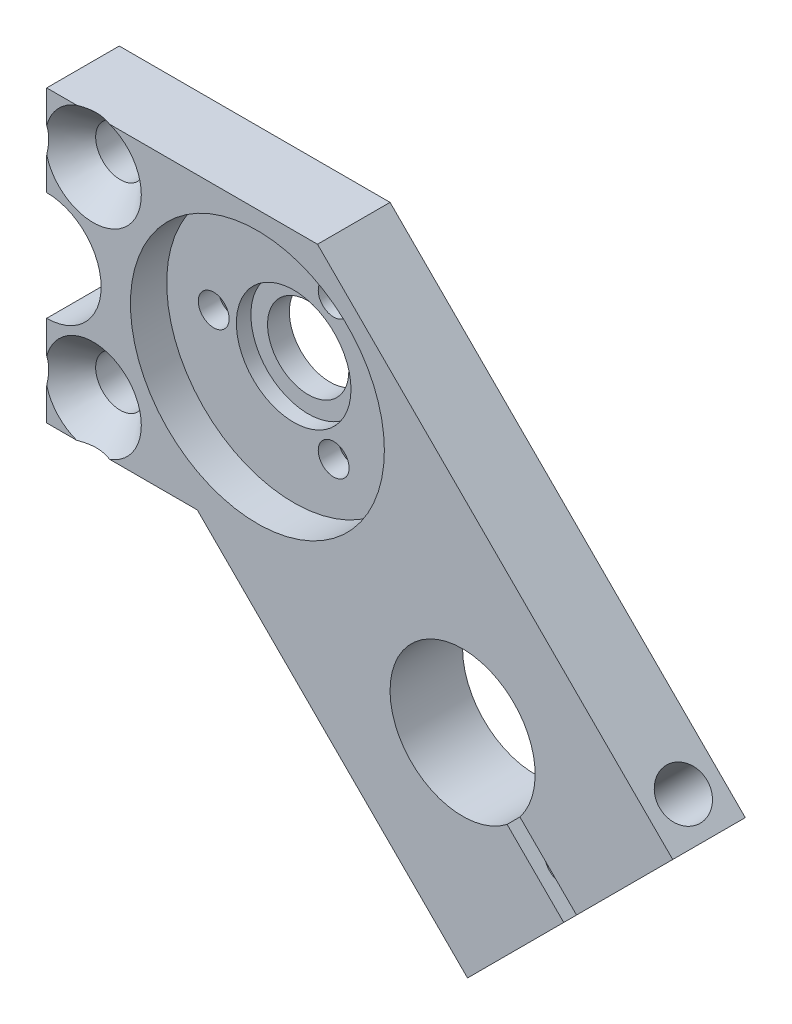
ISO-10303-21;
HEADER;
FILE_DESCRIPTION(('STEP AP214'),'2;1');
FILE_NAME('part.step','',(''),(''),'','','');
FILE_SCHEMA(('AUTOMOTIVE_DESIGN { 1 0 10303 214 1 1 1 1 }'));
ENDSEC;
DATA;
#1=APPLICATION_CONTEXT('core data for automotive mechanical design processes');
#2=APPLICATION_PROTOCOL_DEFINITION('international standard','automotive_design',2000,#1);
#3=PRODUCT_CONTEXT('',#1,'mechanical');
#4=PRODUCT('Part','Part','',(#3));
#5=PRODUCT_RELATED_PRODUCT_CATEGORY('part','',(#4));
#6=PRODUCT_DEFINITION_FORMATION('','',#4);
#7=PRODUCT_DEFINITION_CONTEXT('part definition',#1,'design');
#8=PRODUCT_DEFINITION('design','',#6,#7);
#9=PRODUCT_DEFINITION_SHAPE('','',#8);
#10=(LENGTH_UNIT() NAMED_UNIT(*) SI_UNIT(.MILLI.,.METRE.));
#11=(NAMED_UNIT(*) PLANE_ANGLE_UNIT() SI_UNIT($,.RADIAN.));
#12=(NAMED_UNIT(*) SI_UNIT($,.STERADIAN.) SOLID_ANGLE_UNIT());
#13=UNCERTAINTY_MEASURE_WITH_UNIT(LENGTH_MEASURE(1.E-05),#10,'distance_accuracy_value','');
#14=(GEOMETRIC_REPRESENTATION_CONTEXT(3) GLOBAL_UNCERTAINTY_ASSIGNED_CONTEXT((#13)) GLOBAL_UNIT_ASSIGNED_CONTEXT((#10,
#11,#12)) REPRESENTATION_CONTEXT('',''));
#15=CARTESIAN_POINT('',(0.,0.,0.));
#16=DIRECTION('',(0.,0.,1.));
#17=DIRECTION('',(1.,0.,0.));
#18=AXIS2_PLACEMENT_3D('',#15,#16,#17);
#19=CARTESIAN_POINT('',(-18.4404,0.,0.));
#20=DIRECTION('',(0.,0.,1.));
#21=DIRECTION('',(1.,0.,0.));
#22=AXIS2_PLACEMENT_3D('',#19,#20,#21);
#23=PLANE('',#22);
#24=CARTESIAN_POINT('',(0.,0.,0.));
#25=DIRECTION('',(0.,0.,1.));
#26=DIRECTION('',(1.,0.,0.));
#27=AXIS2_PLACEMENT_3D('',#24,#25,#26);
#28=CIRCLE('',#27,3.556);
#29=CARTESIAN_POINT('',(3.556,0.,0.));
#30=VERTEX_POINT('',#29);
#31=EDGE_CURVE('E179',#30,#30,#28,.T.);
#32=ORIENTED_EDGE('',*,*,#31,.T.);
#33=EDGE_LOOP('',(#32));
#34=FACE_BOUND('',#33,.T.);
#35=CARTESIAN_POINT('',(-18.4404,0.,0.));
#36=DIRECTION('',(0.,0.,-1.));
#37=DIRECTION('',(1.,0.,0.));
#38=AXIS2_PLACEMENT_3D('',#35,#36,#37);
#39=CIRCLE('',#38,4.7625);
#40=CARTESIAN_POINT('',(-18.4404,4.7625,0.));
#41=VERTEX_POINT('',#40);
#42=CARTESIAN_POINT('',(-18.4404,-4.7625,0.));
#43=VERTEX_POINT('',#42);
#44=EDGE_CURVE('E175',#41,#43,#39,.T.);
#45=ORIENTED_EDGE('',*,*,#44,.F.);
#46=DIRECTION('',(0.,-1.,0.));
#47=VECTOR('',#46,1.);
#48=CARTESIAN_POINT('',(-18.4404,12.7,0.));
#49=LINE('',#48,#47);
#50=CARTESIAN_POINT('',(-18.4404,12.7,0.));
#51=VERTEX_POINT('',#50);
#52=EDGE_CURVE('E199',#51,#41,#49,.T.);
#53=ORIENTED_EDGE('',*,*,#52,.F.);
#54=DIRECTION('',(-1.,0.,0.));
#55=VECTOR('',#54,1.);
#56=CARTESIAN_POINT('',(-18.4404,12.7,0.));
#57=LINE('',#56,#55);
#58=CARTESIAN_POINT('',(5.26051224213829,12.7,0.));
#59=VERTEX_POINT('',#58);
#60=EDGE_CURVE('E197',#59,#51,#57,.T.);
#61=ORIENTED_EDGE('',*,*,#60,.F.);
#62=DIRECTION('',(-0.707106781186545,0.70710678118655,0.));
#63=VECTOR('',#62,1.);
#64=CARTESIAN_POINT('',(36.3520767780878,-18.3915645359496,0.));
#65=LINE('',#64,#63);
#66=CARTESIAN_POINT('',(36.3520767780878,-18.3915645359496,0.));
#67=VERTEX_POINT('',#66);
#68=EDGE_CURVE('E195',#67,#59,#65,.T.);
#69=ORIENTED_EDGE('',*,*,#68,.F.);
#70=DIRECTION('',(0.707106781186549,0.707106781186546,0.));
#71=VECTOR('',#70,1.);
#72=CARTESIAN_POINT('',(27.9330866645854,-26.8105546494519,0.));
#73=LINE('',#72,#71);
#74=CARTESIAN_POINT('',(27.9330866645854,-26.8105546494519,0.));
#75=VERTEX_POINT('',#74);
#76=EDGE_CURVE('E193',#75,#67,#73,.T.);
#77=ORIENTED_EDGE('',*,*,#76,.F.);
#78=DIRECTION('',(0.707106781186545,-0.70710678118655,0.));
#79=VECTOR('',#78,1.);
#80=CARTESIAN_POINT('',(22.9766890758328,-21.8541570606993,0.));
#81=LINE('',#80,#79);
#82=CARTESIAN_POINT('',(22.9766890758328,-21.8541570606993,0.));
#83=VERTEX_POINT('',#82);
#84=EDGE_CURVE('E191',#83,#75,#81,.T.);
#85=ORIENTED_EDGE('',*,*,#84,.F.);
#86=CARTESIAN_POINT('',(17.9605122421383,-17.9605122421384,0.));
#87=DIRECTION('',(0.,0.,-1.));
#88=DIRECTION('',(1.,0.,0.));
#89=AXIS2_PLACEMENT_3D('',#86,#87,#88);
#90=CIRCLE('',#89,6.35);
#91=CARTESIAN_POINT('',(21.8541570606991,-22.9766890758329,0.));
#92=VERTEX_POINT('',#91);
#93=EDGE_CURVE('E189',#92,#83,#90,.T.);
#94=ORIENTED_EDGE('',*,*,#93,.F.);
#95=DIRECTION('',(-0.707106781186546,0.707106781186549,0.));
#96=VECTOR('',#95,1.);
#97=CARTESIAN_POINT('',(26.8105546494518,-27.9330866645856,0.));
#98=LINE('',#97,#96);
#99=CARTESIAN_POINT('',(26.8105546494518,-27.9330866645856,0.));
#100=VERTEX_POINT('',#99);
#101=EDGE_CURVE('E187',#100,#92,#98,.T.);
#102=ORIENTED_EDGE('',*,*,#101,.F.);
#103=DIRECTION('',(0.707106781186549,0.707106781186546,0.));
#104=VECTOR('',#103,1.);
#105=CARTESIAN_POINT('',(18.3915645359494,-36.3520767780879,0.));
#106=LINE('',#105,#104);
#107=CARTESIAN_POINT('',(18.3915645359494,-36.3520767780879,0.));
#108=VERTEX_POINT('',#107);
#109=EDGE_CURVE('E185',#108,#100,#106,.T.);
#110=ORIENTED_EDGE('',*,*,#109,.F.);
#111=DIRECTION('',(0.707106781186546,-0.707106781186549,0.));
#112=VECTOR('',#111,1.);
#113=CARTESIAN_POINT('',(-5.26051224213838,-12.7,0.));
#114=LINE('',#113,#112);
#115=CARTESIAN_POINT('',(-5.26051224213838,-12.7,0.));
#116=VERTEX_POINT('',#115);
#117=EDGE_CURVE('E183',#116,#108,#114,.T.);
#118=ORIENTED_EDGE('',*,*,#117,.F.);
#119=DIRECTION('',(1.,0.,0.));
#120=VECTOR('',#119,1.);
#121=CARTESIAN_POINT('',(-18.4404,-12.7,0.));
#122=LINE('',#121,#120);
#123=CARTESIAN_POINT('',(-18.4404,-12.7,0.));
#124=VERTEX_POINT('',#123);
#125=EDGE_CURVE('E181',#124,#116,#122,.T.);
#126=ORIENTED_EDGE('',*,*,#125,.F.);
#127=DIRECTION('',(0.,-1.,0.));
#128=VECTOR('',#127,1.);
#129=CARTESIAN_POINT('',(-18.4404,-4.7625,0.));
#130=LINE('',#129,#128);
#131=EDGE_CURVE('E178',#43,#124,#130,.T.);
#132=ORIENTED_EDGE('',*,*,#131,.F.);
#133=EDGE_LOOP('',(#45,#53,#61,#69,#77,#85,#94,#102,#110,#118,#126,#132));
#134=FACE_BOUND('',#133,.T.);
#135=CARTESIAN_POINT('',(-14.3764,-8.7376,0.));
#136=DIRECTION('',(0.,0.,1.));
#137=DIRECTION('',(1.,0.,0.));
#138=AXIS2_PLACEMENT_3D('',#135,#136,#137);
#139=CIRCLE('',#138,2.15265);
#140=CARTESIAN_POINT('',(-12.22375,-8.7376,0.));
#141=VERTEX_POINT('',#140);
#142=EDGE_CURVE('E160',#141,#141,#139,.T.);
#143=ORIENTED_EDGE('',*,*,#142,.T.);
#144=EDGE_LOOP('',(#143));
#145=FACE_BOUND('',#144,.T.);
#146=CARTESIAN_POINT('',(-14.3764,8.7376,0.));
#147=DIRECTION('',(0.,0.,1.));
#148=DIRECTION('',(1.,0.,0.));
#149=AXIS2_PLACEMENT_3D('',#146,#147,#148);
#150=CIRCLE('',#149,2.15265);
#151=CARTESIAN_POINT('',(-12.22375,8.7376,0.));
#152=VERTEX_POINT('',#151);
#153=EDGE_CURVE('E418',#152,#152,#150,.T.);
#154=ORIENTED_EDGE('',*,*,#153,.T.);
#155=EDGE_LOOP('',(#154));
#156=FACE_BOUND('',#155,.T.);
#157=CARTESIAN_POINT('',(-7.00039818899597,0.,0.));
#158=DIRECTION('',(0.,0.,-1.));
#159=DIRECTION('',(-1.,0.,0.));
#160=AXIS2_PLACEMENT_3D('',#157,#158,#159);
#161=CIRCLE('',#160,2.75);
#162=CARTESIAN_POINT('',(-9.75039818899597,0.,0.));
#163=VERTEX_POINT('',#162);
#164=EDGE_CURVE('E422',#163,#163,#161,.T.);
#165=ORIENTED_EDGE('',*,*,#164,.F.);
#166=EDGE_LOOP('',(#165));
#167=FACE_BOUND('',#166,.T.);
#168=CARTESIAN_POINT('',(3.50019909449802,-6.06252266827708,0.));
#169=DIRECTION('',(0.,0.,-1.));
#170=DIRECTION('',(-1.,0.,0.));
#171=AXIS2_PLACEMENT_3D('',#168,#169,#170);
#172=CIRCLE('',#171,2.75);
#173=CARTESIAN_POINT('',(0.750199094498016,-6.06252266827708,0.));
#174=VERTEX_POINT('',#173);
#175=EDGE_CURVE('E426',#174,#174,#172,.T.);
#176=ORIENTED_EDGE('',*,*,#175,.F.);
#177=EDGE_LOOP('',(#176));
#178=FACE_BOUND('',#177,.T.);
#179=CARTESIAN_POINT('',(3.50019909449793,6.06252266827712,0.));
#180=DIRECTION('',(0.,0.,-1.));
#181=DIRECTION('',(-1.,0.,0.));
#182=AXIS2_PLACEMENT_3D('',#179,#180,#181);
#183=CIRCLE('',#182,2.75);
#184=CARTESIAN_POINT('',(0.750199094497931,6.06252266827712,0.));
#185=VERTEX_POINT('',#184);
#186=EDGE_CURVE('E429',#185,#185,#183,.T.);
#187=ORIENTED_EDGE('',*,*,#186,.F.);
#188=EDGE_LOOP('',(#187));
#189=FACE_BOUND('',#188,.T.);
#190=ADVANCED_FACE('F31',(#34,#134,#145,#156,#167,#178,#189),#23,.F.);
#191=CARTESIAN_POINT('',(0.,0.,6.35));
#192=DIRECTION('',(0.,0.,-1.));
#193=DIRECTION('',(-1.,0.,0.));
#194=AXIS2_PLACEMENT_3D('',#191,#192,#193);
#195=CYLINDRICAL_SURFACE('',#194,3.556);
#196=ORIENTED_EDGE('',*,*,#31,.F.);
#197=EDGE_LOOP('',(#196));
#198=FACE_BOUND('',#197,.T.);
#199=CARTESIAN_POINT('',(0.,0.,1.905));
#200=DIRECTION('',(0.,0.,1.));
#201=DIRECTION('',(1.,0.,0.));
#202=AXIS2_PLACEMENT_3D('',#199,#200,#201);
#203=CIRCLE('',#202,3.556);
#204=CARTESIAN_POINT('',(3.556,0.,1.905));
#205=VERTEX_POINT('',#204);
#206=EDGE_CURVE('E452',#205,#205,#203,.T.);
#207=ORIENTED_EDGE('',*,*,#206,.T.);
#208=EDGE_LOOP('',(#207));
#209=FACE_BOUND('',#208,.T.);
#210=ADVANCED_FACE('F345',(#198,#209),#195,.F.);
#211=CARTESIAN_POINT('',(-18.4404,0.,6.35));
#212=DIRECTION('',(0.,0.,1.));
#213=DIRECTION('',(1.,0.,0.));
#214=AXIS2_PLACEMENT_3D('',#211,#212,#213);
#215=PLANE('',#214);
#216=CARTESIAN_POINT('',(-14.3764,8.7376,6.35));
#217=DIRECTION('',(0.,0.,1.));
#218=DIRECTION('',(1.,0.,0.));
#219=AXIS2_PLACEMENT_3D('',#216,#217,#218);
#220=CIRCLE('',#219,4.2164);
#221=CARTESIAN_POINT('',(-15.8177241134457,12.7,6.35));
#222=VERTEX_POINT('',#221);
#223=CARTESIAN_POINT('',(-18.4404,9.86095789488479,6.35));
#224=VERTEX_POINT('',#223);
#225=EDGE_CURVE('E48',#222,#224,#220,.T.);
#226=ORIENTED_EDGE('',*,*,#225,.F.);
#227=DIRECTION('',(-1.,0.,0.));
#228=VECTOR('',#227,1.);
#229=CARTESIAN_POINT('',(-18.4404,12.7,6.35));
#230=LINE('',#229,#228);
#231=CARTESIAN_POINT('',(-18.4404,12.7,6.35));
#232=VERTEX_POINT('',#231);
#233=EDGE_CURVE('E159',#222,#232,#230,.T.);
#234=ORIENTED_EDGE('',*,*,#233,.T.);
#235=DIRECTION('',(0.,-1.,0.));
#236=VECTOR('',#235,1.);
#237=CARTESIAN_POINT('',(-18.4404,12.7,6.35));
#238=LINE('',#237,#236);
#239=EDGE_CURVE('E168',#232,#224,#238,.T.);
#240=ORIENTED_EDGE('',*,*,#239,.T.);
#241=EDGE_LOOP('',(#226,#234,#240));
#242=FACE_BOUND('',#241,.T.);
#243=ADVANCED_FACE('F318',(#242),#215,.T.);
#244=CARTESIAN_POINT('',(-14.3764,-8.7376,6.35));
#245=DIRECTION('',(0.,0.,1.));
#246=DIRECTION('',(1.,0.,0.));
#247=AXIS2_PLACEMENT_3D('',#244,#245,#246);
#248=CIRCLE('',#247,4.2164);
#249=CARTESIAN_POINT('',(-18.4404,-9.8609578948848,6.35));
#250=VERTEX_POINT('',#249);
#251=CARTESIAN_POINT('',(-15.8177241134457,-12.7,6.35));
#252=VERTEX_POINT('',#251);
#253=EDGE_CURVE('E55',#250,#252,#248,.T.);
#254=ORIENTED_EDGE('',*,*,#253,.F.);
#255=DIRECTION('',(0.,-1.,0.));
#256=VECTOR('',#255,1.);
#257=CARTESIAN_POINT('',(-18.4404,-4.7625,6.35));
#258=LINE('',#257,#256);
#259=CARTESIAN_POINT('',(-18.4404,-12.7,6.35));
#260=VERTEX_POINT('',#259);
#261=EDGE_CURVE('E276',#250,#260,#258,.T.);
#262=ORIENTED_EDGE('',*,*,#261,.T.);
#263=DIRECTION('',(1.,0.,0.));
#264=VECTOR('',#263,1.);
#265=CARTESIAN_POINT('',(-18.4404,-12.7,6.35));
#266=LINE('',#265,#264);
#267=EDGE_CURVE('E281',#260,#252,#266,.T.);
#268=ORIENTED_EDGE('',*,*,#267,.T.);
#269=EDGE_LOOP('',(#254,#262,#268));
#270=FACE_BOUND('',#269,.T.);
#271=ADVANCED_FACE('F409',(#270),#215,.T.);
#272=CARTESIAN_POINT('',(0.,0.,6.35));
#273=DIRECTION('',(0.,0.,1.));
#274=DIRECTION('',(1.,0.,0.));
#275=AXIS2_PLACEMENT_3D('',#272,#273,#274);
#276=CIRCLE('',#275,11.1125);
#277=CARTESIAN_POINT('',(11.1125,0.,6.35));
#278=VERTEX_POINT('',#277);
#279=EDGE_CURVE('E459',#278,#278,#276,.T.);
#280=ORIENTED_EDGE('',*,*,#279,.F.);
#281=EDGE_LOOP('',(#280));
#282=FACE_BOUND('',#281,.T.);
#283=CARTESIAN_POINT('',(-18.4404,7.6142421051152,6.35));
#284=VERTEX_POINT('',#283);
#285=CARTESIAN_POINT('',(-12.9350758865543,12.7,6.35));
#286=VERTEX_POINT('',#285);
#287=EDGE_CURVE('E143',#284,#286,#220,.T.);
#288=ORIENTED_EDGE('',*,*,#287,.F.);
#289=CARTESIAN_POINT('',(-18.4404,4.7625,6.35));
#290=VERTEX_POINT('',#289);
#291=EDGE_CURVE('E166',#284,#290,#238,.T.);
#292=ORIENTED_EDGE('',*,*,#291,.T.);
#293=CARTESIAN_POINT('',(-18.4404,0.,6.35));
#294=DIRECTION('',(0.,0.,-1.));
#295=DIRECTION('',(1.,0.,0.));
#296=AXIS2_PLACEMENT_3D('',#293,#294,#295);
#297=CIRCLE('',#296,4.7625);
#298=CARTESIAN_POINT('',(-18.4404,-4.7625,6.35));
#299=VERTEX_POINT('',#298);
#300=EDGE_CURVE('E201',#290,#299,#297,.T.);
#301=ORIENTED_EDGE('',*,*,#300,.T.);
#302=CARTESIAN_POINT('',(-18.4404,-7.6142421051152,6.35));
#303=VERTEX_POINT('',#302);
#304=EDGE_CURVE('E277',#299,#303,#258,.T.);
#305=ORIENTED_EDGE('',*,*,#304,.T.);
#306=CARTESIAN_POINT('',(-12.9350758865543,-12.7,6.35));
#307=VERTEX_POINT('',#306);
#308=EDGE_CURVE('E270',#307,#303,#248,.T.);
#309=ORIENTED_EDGE('',*,*,#308,.F.);
#310=CARTESIAN_POINT('',(-5.26051224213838,-12.7,6.35));
#311=VERTEX_POINT('',#310);
#312=EDGE_CURVE('E280',#307,#311,#266,.T.);
#313=ORIENTED_EDGE('',*,*,#312,.T.);
#314=DIRECTION('',(0.707106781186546,-0.707106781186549,0.));
#315=VECTOR('',#314,1.);
#316=CARTESIAN_POINT('',(-5.26051224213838,-12.7,6.35));
#317=LINE('',#316,#315);
#318=CARTESIAN_POINT('',(18.3915645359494,-36.3520767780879,6.35));
#319=VERTEX_POINT('',#318);
#320=EDGE_CURVE('E284',#311,#319,#317,.T.);
#321=ORIENTED_EDGE('',*,*,#320,.T.);
#322=DIRECTION('',(0.707106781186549,0.707106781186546,0.));
#323=VECTOR('',#322,1.);
#324=CARTESIAN_POINT('',(18.3915645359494,-36.3520767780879,6.35));
#325=LINE('',#324,#323);
#326=CARTESIAN_POINT('',(26.8105546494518,-27.9330866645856,6.35));
#327=VERTEX_POINT('',#326);
#328=EDGE_CURVE('E286',#319,#327,#325,.T.);
#329=ORIENTED_EDGE('',*,*,#328,.T.);
#330=DIRECTION('',(-0.707106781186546,0.707106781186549,0.));
#331=VECTOR('',#330,1.);
#332=CARTESIAN_POINT('',(26.8105546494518,-27.9330866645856,6.35));
#333=LINE('',#332,#331);
#334=CARTESIAN_POINT('',(21.8541570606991,-22.9766890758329,6.35));
#335=VERTEX_POINT('',#334);
#336=EDGE_CURVE('E288',#327,#335,#333,.T.);
#337=ORIENTED_EDGE('',*,*,#336,.T.);
#338=CARTESIAN_POINT('',(17.9605122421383,-17.9605122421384,6.35));
#339=DIRECTION('',(0.,0.,-1.));
#340=DIRECTION('',(1.,0.,0.));
#341=AXIS2_PLACEMENT_3D('',#338,#339,#340);
#342=CIRCLE('',#341,6.35);
#343=CARTESIAN_POINT('',(22.9766890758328,-21.8541570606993,6.35));
#344=VERTEX_POINT('',#343);
#345=EDGE_CURVE('E290',#335,#344,#342,.T.);
#346=ORIENTED_EDGE('',*,*,#345,.T.);
#347=DIRECTION('',(0.707106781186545,-0.70710678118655,0.));
#348=VECTOR('',#347,1.);
#349=CARTESIAN_POINT('',(22.9766890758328,-21.8541570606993,6.35));
#350=LINE('',#349,#348);
#351=CARTESIAN_POINT('',(27.9330866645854,-26.8105546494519,6.35));
#352=VERTEX_POINT('',#351);
#353=EDGE_CURVE('E292',#344,#352,#350,.T.);
#354=ORIENTED_EDGE('',*,*,#353,.T.);
#355=DIRECTION('',(0.707106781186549,0.707106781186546,0.));
#356=VECTOR('',#355,1.);
#357=CARTESIAN_POINT('',(27.9330866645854,-26.8105546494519,6.35));
#358=LINE('',#357,#356);
#359=CARTESIAN_POINT('',(36.3520767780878,-18.3915645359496,6.35));
#360=VERTEX_POINT('',#359);
#361=EDGE_CURVE('E293',#352,#360,#358,.T.);
#362=ORIENTED_EDGE('',*,*,#361,.T.);
#363=DIRECTION('',(-0.707106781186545,0.70710678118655,0.));
#364=VECTOR('',#363,1.);
#365=CARTESIAN_POINT('',(36.3520767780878,-18.3915645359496,6.35));
#366=LINE('',#365,#364);
#367=CARTESIAN_POINT('',(5.26051224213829,12.7,6.35));
#368=VERTEX_POINT('',#367);
#369=EDGE_CURVE('E164',#360,#368,#366,.T.);
#370=ORIENTED_EDGE('',*,*,#369,.T.);
#371=EDGE_CURVE('E157',#368,#286,#230,.T.);
#372=ORIENTED_EDGE('',*,*,#371,.T.);
#373=EDGE_LOOP('',(#288,#292,#301,#305,#309,#313,#321,#329,#337,#346,#354,#362,#370,#372));
#374=FACE_BOUND('',#373,.T.);
#375=ADVANCED_FACE('F162',(#282,#374),#215,.T.);
#376=CARTESIAN_POINT('',(-18.4404,0.,6.35));
#377=DIRECTION('',(0.,0.,-1.));
#378=DIRECTION('',(-1.,0.,0.));
#379=AXIS2_PLACEMENT_3D('',#376,#377,#378);
#380=CYLINDRICAL_SURFACE('',#379,4.7625);
#381=ORIENTED_EDGE('',*,*,#44,.T.);
#382=DIRECTION('',(0.,0.,-1.));
#383=VECTOR('',#382,1.);
#384=CARTESIAN_POINT('',(-18.4404,-4.7625,6.35));
#385=LINE('',#384,#383);
#386=EDGE_CURVE('E233',#299,#43,#385,.T.);
#387=ORIENTED_EDGE('',*,*,#386,.F.);
#388=ORIENTED_EDGE('',*,*,#300,.F.);
#389=DIRECTION('',(0.,0.,-1.));
#390=VECTOR('',#389,1.);
#391=CARTESIAN_POINT('',(-18.4404,4.7625,6.35));
#392=LINE('',#391,#390);
#393=EDGE_CURVE('E174',#290,#41,#392,.T.);
#394=ORIENTED_EDGE('',*,*,#393,.T.);
#395=EDGE_LOOP('',(#381,#387,#388,#394));
#396=FACE_BOUND('',#395,.T.);
#397=ADVANCED_FACE('F33',(#396),#380,.F.);
#398=CARTESIAN_POINT('',(-18.4404,-4.7625,6.35));
#399=DIRECTION('',(1.,0.,0.));
#400=DIRECTION('',(0.,0.,-1.));
#401=AXIS2_PLACEMENT_3D('',#398,#399,#400);
#402=PLANE('',#401);
#403=ORIENTED_EDGE('',*,*,#261,.F.);
#404=CARTESIAN_POINT('',(-18.4404,-15.8395148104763,10.9124749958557));
#405=CARTESIAN_POINT('',(-18.4404,-15.6998986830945,10.7730902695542));
#406=CARTESIAN_POINT('',(-18.4404,-15.5597882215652,10.6341970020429));
#407=CARTESIAN_POINT('',(-18.4404,-15.2783757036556,10.3576056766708));
#408=CARTESIAN_POINT('',(-18.4404,-15.1370735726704,10.2199076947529));
#409=CARTESIAN_POINT('',(-18.4404,-14.8527812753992,9.94563675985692));
#410=CARTESIAN_POINT('',(-18.4404,-14.709788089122,9.80906693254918));
#411=CARTESIAN_POINT('',(-18.4404,-14.4221688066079,9.53766169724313));
#412=CARTESIAN_POINT('',(-18.4404,-14.277542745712,9.40282625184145));
#413=CARTESIAN_POINT('',(-18.4404,-13.9794760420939,9.1289611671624));
#414=CARTESIAN_POINT('',(-18.4404,-13.8259413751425,8.99003363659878));
#415=CARTESIAN_POINT('',(-18.4404,-13.5162887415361,8.71508994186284));
#416=CARTESIAN_POINT('',(-18.4404,-13.3601708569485,8.57907368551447));
#417=CARTESIAN_POINT('',(-18.4404,-13.0449089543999,8.31087017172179));
#418=CARTESIAN_POINT('',(-18.4404,-12.8857677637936,8.17867960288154));
#419=CARTESIAN_POINT('',(-18.4404,-12.5636038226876,7.91913397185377));
#420=CARTESIAN_POINT('',(-18.4404,-12.4005815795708,7.79177828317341));
#421=CARTESIAN_POINT('',(-18.4404,-12.0701807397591,7.5438439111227));
#422=CARTESIAN_POINT('',(-18.4404,-11.9028163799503,7.42324638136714));
#423=CARTESIAN_POINT('',(-18.4404,-11.5619937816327,7.19065011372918));
#424=CARTESIAN_POINT('',(-18.4404,-11.3885318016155,7.07865679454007));
#425=CARTESIAN_POINT('',(-18.4404,-11.0363953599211,6.86802211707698));
#426=CARTESIAN_POINT('',(-18.4404,-10.8578072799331,6.76923797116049));
#427=CARTESIAN_POINT('',(-18.4404,-10.4924442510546,6.58838854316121));
#428=CARTESIAN_POINT('',(-18.4404,-10.3056829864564,6.50629652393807));
#429=CARTESIAN_POINT('',(-18.4404,-10.0278276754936,6.40372350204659));
#430=CARTESIAN_POINT('',(-18.4404,-9.94010537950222,6.37405759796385));
#431=CARTESIAN_POINT('',(-18.4404,-9.76278877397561,6.32013543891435));
#432=CARTESIAN_POINT('',(-18.4404,-9.67319080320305,6.29589110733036));
#433=CARTESIAN_POINT('',(-18.4404,-9.47908942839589,6.25042599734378));
#434=CARTESIAN_POINT('',(-18.4404,-9.37435129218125,6.23019137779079));
#435=CARTESIAN_POINT('',(-18.4404,-9.16349204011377,6.19874723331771));
#436=CARTESIAN_POINT('',(-18.4404,-9.05737066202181,6.18753944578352));
#437=CARTESIAN_POINT('',(-18.4404,-8.844655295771,6.17471152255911));
#438=CARTESIAN_POINT('',(-18.4404,-8.73806193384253,6.17308115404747));
#439=CARTESIAN_POINT('',(-18.4404,-8.52517333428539,6.17946545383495));
#440=CARTESIAN_POINT('',(-18.4404,-8.4188780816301,6.18747962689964));
#441=CARTESIAN_POINT('',(-18.4404,-8.21137051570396,6.21227399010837));
#442=CARTESIAN_POINT('',(-18.4404,-8.11011693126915,6.2287146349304));
#443=CARTESIAN_POINT('',(-18.4404,-7.90920086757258,6.26946353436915));
#444=CARTESIAN_POINT('',(-18.4404,-7.80953873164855,6.29377346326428));
#445=CARTESIAN_POINT('',(-18.4404,-7.61204934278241,6.34941962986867));
#446=CARTESIAN_POINT('',(-18.4404,-7.51422516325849,6.38076666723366));
#447=CARTESIAN_POINT('',(-18.4404,-7.32075288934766,6.44952502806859));
#448=CARTESIAN_POINT('',(-18.4404,-7.22510480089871,6.48693636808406));
#449=CARTESIAN_POINT('',(-18.4404,-7.00496946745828,6.5800564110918));
#450=CARTESIAN_POINT('',(-18.4404,-6.88132022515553,6.63774048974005));
#451=CARTESIAN_POINT('',(-18.4404,-6.63767160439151,6.76040479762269));
#452=CARTESIAN_POINT('',(-18.4404,-6.51767392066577,6.82538835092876));
#453=CARTESIAN_POINT('',(-18.4404,-6.28083017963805,6.96126422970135));
#454=CARTESIAN_POINT('',(-18.4404,-6.16398966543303,7.03216615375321));
#455=CARTESIAN_POINT('',(-18.4404,-5.93326092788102,7.17862793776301));
#456=CARTESIAN_POINT('',(-18.4404,-5.81937311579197,7.25418844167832));
#457=CARTESIAN_POINT('',(-18.4404,-5.59245452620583,7.41024612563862));
#458=CARTESIAN_POINT('',(-18.4404,-5.47946382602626,7.49080133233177));
#459=CARTESIAN_POINT('',(-18.4404,-5.25578795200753,7.6550468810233));
#460=CARTESIAN_POINT('',(-18.4404,-5.14510284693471,7.7387373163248));
#461=CARTESIAN_POINT('',(-18.4404,-4.92584750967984,7.90859389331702));
#462=CARTESIAN_POINT('',(-18.4404,-4.81727510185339,7.99475723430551));
#463=CARTESIAN_POINT('',(-18.4404,-4.60185955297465,8.16920380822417));
#464=CARTESIAN_POINT('',(-18.4404,-4.4950163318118,8.25748694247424));
#465=CARTESIAN_POINT('',(-18.4404,-4.25173877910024,8.4619542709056));
#466=CARTESIAN_POINT('',(-18.4404,-4.11580610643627,8.57873483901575));
#467=CARTESIAN_POINT('',(-18.4404,-3.84603130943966,8.81468955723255));
#468=CARTESIAN_POINT('',(-18.4404,-3.71218927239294,8.93386380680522));
#469=CARTESIAN_POINT('',(-18.4404,-3.3132520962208,9.29433316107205));
#470=CARTESIAN_POINT('',(-18.4404,-3.05078776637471,9.53853919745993));
#471=CARTESIAN_POINT('',(-18.4404,-2.53079863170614,10.0324258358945));
#472=CARTESIAN_POINT('',(-18.4404,-2.27327687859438,10.2821096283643));
#473=CARTESIAN_POINT('',(-18.4404,-1.76203854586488,10.7853521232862));
#474=CARTESIAN_POINT('',(-18.4404,-1.50832209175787,11.0389109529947));
#475=CARTESIAN_POINT('',(-18.4404,-1.00313063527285,11.5495912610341));
#476=CARTESIAN_POINT('',(-18.4404,-0.751663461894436,11.8067204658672));
#477=CARTESIAN_POINT('',(-18.4404,-0.251014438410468,12.3232008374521));
#478=CARTESIAN_POINT('',(-18.4404,-0.00183263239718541,12.5825520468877));
#479=CARTESIAN_POINT('',(-18.4404,0.494616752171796,13.1028906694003));
#480=CARTESIAN_POINT('',(-18.4404,0.741885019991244,13.3638774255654));
#481=CARTESIAN_POINT('',(-18.4404,1.23495096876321,13.887236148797));
#482=CARTESIAN_POINT('',(-18.4404,1.48074864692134,14.1496081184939));
#483=CARTESIAN_POINT('',(-18.4404,2.15009330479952,14.8673563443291));
#484=CARTESIAN_POINT('',(-18.4404,2.57244719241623,15.3238449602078));
#485=CARTESIAN_POINT('',(-18.4404,3.41459795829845,16.2392638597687));
#486=CARTESIAN_POINT('',(-18.4404,3.83439454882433,16.6981944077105));
#487=CARTESIAN_POINT('',(-18.4404,4.67005266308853,17.6156562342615));
#488=CARTESIAN_POINT('',(-18.4404,5.08592340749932,18.0741791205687));
#489=CARTESIAN_POINT('',(-18.4404,5.91609715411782,18.9925378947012));
#490=CARTESIAN_POINT('',(-18.4404,6.33040034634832,19.4523736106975));
#491=CARTESIAN_POINT('',(-18.4404,6.74415505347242,19.9126995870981));
#492=B_SPLINE_CURVE_WITH_KNOTS('',3,(#404,#405,#406,#407,#408,#409,#410,#411,#412,#413,#414,
#415,#416,#417,#418,#419,#420,#421,#422,#423,#424,#425,#426,#427,#428,#429,#430,#431,#432,#433,
#434,#435,#436,#437,#438,#439,#440,#441,#442,#443,#444,#445,#446,#447,#448,#449,#450,#451,#452,
#453,#454,#455,#456,#457,#458,#459,#460,#461,#462,#463,#464,#465,#466,#467,#468,#469,#470,#471,
#472,#473,#474,#475,#476,#477,#478,#479,#480,#481,#482,#483,#484,#485,#486,#487,#488,#489,#490,
#491),.UNSPECIFIED.,.F.,.F.,(4,2,2,2,2,2,2,2,2,2,2,2,2,2,2,2,2,2,2,2,2,2,2,2,2,2,2,2,2,2,2,2,2,
2,2,2,2,2,2,2,2,2,2,4),(0.,0.591853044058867,1.18374342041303,1.77693053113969,2.37010482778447,
2.99125489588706,3.6123852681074,4.23296087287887,4.85345578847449,5.47212410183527,
6.09117889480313,6.70288091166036,7.31359526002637,7.59125749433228,7.86952449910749,
8.1891826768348,8.50890236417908,8.82828039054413,9.14764201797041,9.45504293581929,
9.76250929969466,10.0704507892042,10.3783931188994,10.7874044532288,11.1966028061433,
11.6064782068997,12.0164103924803,12.4326432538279,12.8488885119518,13.2646796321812,
13.6804514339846,14.2180377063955,14.7556463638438,15.8310286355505,16.9070548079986,
17.9831163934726,19.062061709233,20.1410277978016,21.2195852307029,22.2981447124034,
24.1638411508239,26.02974377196,27.8868144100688,29.7436522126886),.UNSPECIFIED.);
#493=EDGE_CURVE('E263',#250,#303,#492,.T.);
#494=ORIENTED_EDGE('',*,*,#493,.T.);
#495=ORIENTED_EDGE('',*,*,#304,.F.);
#496=ORIENTED_EDGE('',*,*,#386,.T.);
#497=ORIENTED_EDGE('',*,*,#131,.T.);
#498=DIRECTION('',(0.,0.,-1.));
#499=VECTOR('',#498,1.);
#500=CARTESIAN_POINT('',(-18.4404,-12.7,6.35));
#501=LINE('',#500,#499);
#502=EDGE_CURVE('E230',#260,#124,#501,.T.);
#503=ORIENTED_EDGE('',*,*,#502,.F.);
#504=EDGE_LOOP('',(#403,#494,#495,#496,#497,#503));
#505=FACE_BOUND('',#504,.T.);
#506=ADVANCED_FACE('F256',(#505),#402,.F.);
#507=CARTESIAN_POINT('',(-18.4404,-12.7,6.35));
#508=DIRECTION('',(0.,1.,0.));
#509=DIRECTION('',(-1.,0.,0.));
#510=AXIS2_PLACEMENT_3D('',#507,#508,#509);
#511=PLANE('',#510);
#512=ORIENTED_EDGE('',*,*,#312,.F.);
#513=CARTESIAN_POINT('',(-21.4531489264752,-12.7,10.8297048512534));
#514=CARTESIAN_POINT('',(-21.3131516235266,-12.7,10.689199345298));
#515=CARTESIAN_POINT('',(-21.1726695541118,-12.7,10.5491732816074));
#516=CARTESIAN_POINT('',(-20.8905332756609,-12.7,10.2702900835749));
#517=CARTESIAN_POINT('',(-20.748878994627,-12.7,10.1314330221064));
#518=CARTESIAN_POINT('',(-20.4639003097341,-12.7,9.85481183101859));
#519=CARTESIAN_POINT('',(-20.3205729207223,-12.7,9.71705077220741));
#520=CARTESIAN_POINT('',(-20.0323038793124,-12.7,9.44323213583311));
#521=CARTESIAN_POINT('',(-19.8873622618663,-12.7,9.30717452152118));
#522=CARTESIAN_POINT('',(-19.5885064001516,-12.7,9.03062643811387));
#523=CARTESIAN_POINT('',(-19.4344966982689,-12.7,8.89023890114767));
#524=CARTESIAN_POINT('',(-19.1238998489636,-12.7,8.61234654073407));
#525=CARTESIAN_POINT('',(-18.9673127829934,-12.7,8.4748416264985));
#526=CARTESIAN_POINT('',(-18.6511070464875,-12.7,8.2036424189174));
#527=CARTESIAN_POINT('',(-18.4914912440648,-12.7,8.0699447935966));
#528=CARTESIAN_POINT('',(-18.1683476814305,-12.7,7.8073816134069));
#529=CARTESIAN_POINT('',(-18.004820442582,-12.7,7.67851542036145));
#530=CARTESIAN_POINT('',(-17.6754304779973,-12.7,7.42918174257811));
#531=CARTESIAN_POINT('',(-17.5096434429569,-12.7,7.30861491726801));
#532=CARTESIAN_POINT('',(-17.1720105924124,-12.7,7.07593793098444));
#533=CARTESIAN_POINT('',(-17.0001609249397,-12.7,6.9638332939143));
#534=CARTESIAN_POINT('',(-16.6512637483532,-12.7,6.75285863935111));
#535=CARTESIAN_POINT('',(-16.4743037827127,-12.7,6.65384547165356));
#536=CARTESIAN_POINT('',(-16.1121446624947,-12.7,6.47244601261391));
#537=CARTESIAN_POINT('',(-15.9269596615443,-12.7,6.39003241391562));
#538=CARTESIAN_POINT('',(-15.6538876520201,-12.7,6.28798796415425));
#539=CARTESIAN_POINT('',(-15.5694723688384,-12.7,6.25901277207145));
#540=CARTESIAN_POINT('',(-15.3988425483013,-12.7,6.20615912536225));
#541=CARTESIAN_POINT('',(-15.3126244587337,-12.7,6.18229203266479));
#542=CARTESIAN_POINT('',(-15.1245531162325,-12.7,6.13695232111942));
#543=CARTESIAN_POINT('',(-15.0224477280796,-12.7,6.11650874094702));
#544=CARTESIAN_POINT('',(-14.8168315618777,-12.7,6.0843817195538));
#545=CARTESIAN_POINT('',(-14.7133205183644,-12.7,6.07269995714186));
#546=CARTESIAN_POINT('',(-14.5057741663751,-12.7,6.05868043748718));
#547=CARTESIAN_POINT('',(-14.4017395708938,-12.7,6.05633227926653));
#548=CARTESIAN_POINT('',(-14.1938939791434,-12.7,6.06107322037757));
#549=CARTESIAN_POINT('',(-14.0900829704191,-12.7,6.06816177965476));
#550=CARTESIAN_POINT('',(-13.8872296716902,-12.7,6.09099449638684));
#551=CARTESIAN_POINT('',(-13.7881505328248,-12.7,6.10641690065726));
#552=CARTESIAN_POINT('',(-13.59151422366,-12.7,6.14503407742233));
#553=CARTESIAN_POINT('',(-13.4939573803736,-12.7,6.16823049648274));
#554=CARTESIAN_POINT('',(-13.3006195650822,-12.7,6.2215779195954));
#555=CARTESIAN_POINT('',(-13.2048416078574,-12.7,6.25173973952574));
#556=CARTESIAN_POINT('',(-13.0154107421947,-12.7,6.31807371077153));
#557=CARTESIAN_POINT('',(-12.9217578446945,-12.7,6.35424589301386));
#558=CARTESIAN_POINT('',(-12.7084921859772,-12.7,6.44347916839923));
#559=CARTESIAN_POINT('',(-12.5896320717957,-12.7,6.49833334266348));
#560=CARTESIAN_POINT('',(-12.3553764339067,-12.7,6.61504038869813));
#561=CARTESIAN_POINT('',(-12.2399824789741,-12.7,6.67689637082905));
#562=CARTESIAN_POINT('',(-12.0121998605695,-12.7,6.80629396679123));
#563=CARTESIAN_POINT('',(-11.8998164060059,-12.7,6.87384468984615));
#564=CARTESIAN_POINT('',(-11.6778739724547,-12.7,7.01344341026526));
#565=CARTESIAN_POINT('',(-11.5683153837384,-12.7,7.08549202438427));
#566=CARTESIAN_POINT('',(-11.3500468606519,-12.7,7.23433030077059));
#567=CARTESIAN_POINT('',(-11.2413746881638,-12.7,7.31117510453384));
#568=CARTESIAN_POINT('',(-11.02624824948,-12.7,7.46790417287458));
#569=CARTESIAN_POINT('',(-10.9197940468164,-12.7,7.54778852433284));
#570=CARTESIAN_POINT('',(-10.7089217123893,-12.7,7.70996395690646));
#571=CARTESIAN_POINT('',(-10.6045015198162,-12.7,7.79225236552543));
#572=CARTESIAN_POINT('',(-10.3973336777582,-12.7,7.95889406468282));
#573=CARTESIAN_POINT('',(-10.2945859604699,-12.7,8.04324727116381));
#574=CARTESIAN_POINT('',(-9.95433791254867,-12.7,8.32741557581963));
#575=CARTESIAN_POINT('',(-9.72003355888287,-12.7,8.53105857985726));
#576=CARTESIAN_POINT('',(-9.25712515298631,-12.7,8.94474207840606));
#577=CARTESIAN_POINT('',(-9.028522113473,-12.7,9.15478369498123));
#578=CARTESIAN_POINT('',(-8.57549921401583,-12.7,9.57955073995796));
#579=CARTESIAN_POINT('',(-8.35108157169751,-12.7,9.79427852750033));
#580=CARTESIAN_POINT('',(-7.90553585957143,-12.7,10.2271225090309));
#581=CARTESIAN_POINT('',(-7.6844078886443,-12.7,10.4452388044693));
#582=CARTESIAN_POINT('',(-7.24418167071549,-12.7,10.8845866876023));
#583=CARTESIAN_POINT('',(-7.02508978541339,-12.7,11.1058246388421));
#584=CARTESIAN_POINT('',(-6.58896103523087,-12.7,11.5503201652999));
#585=CARTESIAN_POINT('',(-6.37192420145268,-12.7,11.7735777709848));
#586=CARTESIAN_POINT('',(-5.72342054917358,-12.7,12.4455814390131));
#587=CARTESIAN_POINT('',(-5.29441659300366,-12.7,12.8967032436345));
#588=CARTESIAN_POINT('',(-4.49313537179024,-12.7,13.7475816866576));
#589=CARTESIAN_POINT('',(-4.12034778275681,-12.7,14.1468597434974));
#590=CARTESIAN_POINT('',(-3.37727519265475,-12.7,14.9478067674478));
#591=CARTESIAN_POINT('',(-3.00699042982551,-12.7,15.3494759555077));
#592=CARTESIAN_POINT('',(-2.27000324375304,-12.7,16.1527516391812));
#593=CARTESIAN_POINT('',(-1.90329219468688,-12.6999999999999,16.554350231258));
#594=CARTESIAN_POINT('',(-1.1714098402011,-12.6999999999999,17.3588667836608));
#595=CARTESIAN_POINT('',(-0.806238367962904,-12.6999999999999,17.7617845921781));
#596=CARTESIAN_POINT('',(-0.441616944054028,-12.6999999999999,18.1651970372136));
#597=B_SPLINE_CURVE_WITH_KNOTS('',3,(#513,#514,#515,#516,#517,#518,#519,#520,#521,#522,#523,
#524,#525,#526,#527,#528,#529,#530,#531,#532,#533,#534,#535,#536,#537,#538,#539,#540,#541,#542,
#543,#544,#545,#546,#547,#548,#549,#550,#551,#552,#553,#554,#555,#556,#557,#558,#559,#560,#561,
#562,#563,#564,#565,#566,#567,#568,#569,#570,#571,#572,#573,#574,#575,#576,#577,#578,#579,#580,
#581,#582,#583,#584,#585,#586,#587,#588,#589,#590,#591,#592,#593,#594,#595,#596),.UNSPECIFIED.,
.F.,.F.,(4,2,2,2,2,2,2,2,2,2,2,2,2,2,2,2,2,2,2,2,2,2,2,2,2,2,2,2,2,2,2,2,2,2,2,2,2,2,2,2,2,4),
(0.,0.595039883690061,1.19011659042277,1.78650047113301,2.38287146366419,3.00802193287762,
3.63315268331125,4.25771839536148,4.88220131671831,5.49698762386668,6.11217183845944,
6.71994595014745,7.32671191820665,7.59432607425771,7.86252943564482,8.17457145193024,
8.48667324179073,8.79842714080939,9.1101631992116,9.41064394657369,9.7111883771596,
10.012202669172,10.3132185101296,10.7056402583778,11.0982370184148,11.4914741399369,
11.8847653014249,12.2839920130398,12.6832301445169,13.0820401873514,13.480834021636,
14.4119352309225,15.3432006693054,16.2749462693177,17.2067198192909,18.1407946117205,
19.0748835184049,20.9424485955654,22.5812000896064,24.2201054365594,25.8516118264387,
27.4829366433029),.UNSPECIFIED.);
#598=EDGE_CURVE('E40',#307,#252,#597,.F.);
#599=ORIENTED_EDGE('',*,*,#598,.T.);
#600=ORIENTED_EDGE('',*,*,#267,.F.);
#601=ORIENTED_EDGE('',*,*,#502,.T.);
#602=ORIENTED_EDGE('',*,*,#125,.T.);
#603=DIRECTION('',(0.,0.,-1.));
#604=VECTOR('',#603,1.);
#605=CARTESIAN_POINT('',(-5.26051224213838,-12.7,6.35));
#606=LINE('',#605,#604);
#607=EDGE_CURVE('E227',#311,#116,#606,.T.);
#608=ORIENTED_EDGE('',*,*,#607,.F.);
#609=EDGE_LOOP('',(#512,#599,#600,#601,#602,#608));
#610=FACE_BOUND('',#609,.T.);
#611=ADVANCED_FACE('F251',(#610),#511,.F.);
#612=CARTESIAN_POINT('',(-5.26051224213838,-12.7,6.35));
#613=DIRECTION('',(0.707106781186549,0.707106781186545,0.));
#614=DIRECTION('',(-0.707106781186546,0.70710678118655,0.));
#615=AXIS2_PLACEMENT_3D('',#612,#613,#614);
#616=PLANE('',#615);
#617=CARTESIAN_POINT('',(16.1465005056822,-34.1070127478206,3.175));
#618=DIRECTION('',(-0.70710678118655,-0.707106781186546,0.));
#619=DIRECTION('',(0.707106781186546,-0.70710678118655,0.));
#620=AXIS2_PLACEMENT_3D('',#617,#618,#619);
#621=CIRCLE('',#620,2.15265);
#622=CARTESIAN_POINT('',(17.6686539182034,-35.6291661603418,3.175));
#623=VERTEX_POINT('',#622);
#624=EDGE_CURVE('E527',#623,#623,#621,.T.);
#625=ORIENTED_EDGE('',*,*,#624,.F.);
#626=EDGE_LOOP('',(#625));
#627=FACE_BOUND('',#626,.T.);
#628=ORIENTED_EDGE('',*,*,#117,.T.);
#629=DIRECTION('',(0.,0.,-1.));
#630=VECTOR('',#629,1.);
#631=CARTESIAN_POINT('',(18.3915645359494,-36.3520767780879,6.35));
#632=LINE('',#631,#630);
#633=EDGE_CURVE('E224',#319,#108,#632,.T.);
#634=ORIENTED_EDGE('',*,*,#633,.F.);
#635=ORIENTED_EDGE('',*,*,#320,.F.);
#636=ORIENTED_EDGE('',*,*,#607,.T.);
#637=EDGE_LOOP('',(#628,#634,#635,#636));
#638=FACE_BOUND('',#637,.T.);
#639=ADVANCED_FACE('F255',(#627,#638),#616,.F.);
#640=CARTESIAN_POINT('',(18.3915645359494,-36.3520767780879,6.35));
#641=DIRECTION('',(-0.707106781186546,0.707106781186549,0.));
#642=DIRECTION('',(-0.707106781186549,-0.707106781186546,0.));
#643=AXIS2_PLACEMENT_3D('',#640,#641,#642);
#644=PLANE('',#643);
#645=ORIENTED_EDGE('',*,*,#109,.T.);
#646=DIRECTION('',(0.,0.,-1.));
#647=VECTOR('',#646,1.);
#648=CARTESIAN_POINT('',(26.8105546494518,-27.9330866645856,6.35));
#649=LINE('',#648,#647);
#650=EDGE_CURVE('E221',#327,#100,#649,.T.);
#651=ORIENTED_EDGE('',*,*,#650,.F.);
#652=ORIENTED_EDGE('',*,*,#328,.F.);
#653=ORIENTED_EDGE('',*,*,#633,.T.);
#654=EDGE_LOOP('',(#645,#651,#652,#653));
#655=FACE_BOUND('',#654,.T.);
#656=ADVANCED_FACE('F378',(#655),#644,.F.);
#657=CARTESIAN_POINT('',(26.8105546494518,-27.9330866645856,6.35));
#658=DIRECTION('',(-0.707106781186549,-0.707106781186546,0.));
#659=DIRECTION('',(0.707106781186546,-0.707106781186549,0.));
#660=AXIS2_PLACEMENT_3D('',#657,#658,#659);
#661=PLANE('',#660);
#662=CARTESIAN_POINT('',(24.5654906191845,-25.6880226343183,3.175));
#663=DIRECTION('',(-0.707106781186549,-0.707106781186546,0.));
#664=DIRECTION('',(0.707106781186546,-0.707106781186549,0.));
#665=AXIS2_PLACEMENT_3D('',#662,#663,#664);
#666=CIRCLE('',#665,2.15265);
#667=CARTESIAN_POINT('',(26.0876440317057,-27.2101760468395,3.175));
#668=VERTEX_POINT('',#667);
#669=EDGE_CURVE('E35',#668,#668,#666,.T.);
#670=ORIENTED_EDGE('',*,*,#669,.T.);
#671=EDGE_LOOP('',(#670));
#672=FACE_BOUND('',#671,.T.);
#673=ORIENTED_EDGE('',*,*,#101,.T.);
#674=DIRECTION('',(0.,0.,-1.));
#675=VECTOR('',#674,1.);
#676=CARTESIAN_POINT('',(21.8541570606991,-22.9766890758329,6.35));
#677=LINE('',#676,#675);
#678=EDGE_CURVE('E218',#335,#92,#677,.T.);
#679=ORIENTED_EDGE('',*,*,#678,.F.);
#680=ORIENTED_EDGE('',*,*,#336,.F.);
#681=ORIENTED_EDGE('',*,*,#650,.T.);
#682=EDGE_LOOP('',(#673,#679,#680,#681));
#683=FACE_BOUND('',#682,.T.);
#684=ADVANCED_FACE('F375',(#672,#683),#661,.F.);
#685=CARTESIAN_POINT('',(17.9605122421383,-17.9605122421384,6.35));
#686=DIRECTION('',(0.,0.,-1.));
#687=DIRECTION('',(-1.,0.,0.));
#688=AXIS2_PLACEMENT_3D('',#685,#686,#687);
#689=CYLINDRICAL_SURFACE('',#688,6.35);
#690=ORIENTED_EDGE('',*,*,#93,.T.);
#691=DIRECTION('',(0.,0.,-1.));
#692=VECTOR('',#691,1.);
#693=CARTESIAN_POINT('',(22.9766890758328,-21.8541570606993,6.35));
#694=LINE('',#693,#692);
#695=EDGE_CURVE('E215',#344,#83,#694,.T.);
#696=ORIENTED_EDGE('',*,*,#695,.F.);
#697=ORIENTED_EDGE('',*,*,#345,.F.);
#698=ORIENTED_EDGE('',*,*,#678,.T.);
#699=EDGE_LOOP('',(#690,#696,#697,#698));
#700=FACE_BOUND('',#699,.T.);
#701=ADVANCED_FACE('F371',(#700),#689,.F.);
#702=CARTESIAN_POINT('',(22.9766890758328,-21.8541570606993,6.35));
#703=DIRECTION('',(0.70710678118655,0.707106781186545,0.));
#704=DIRECTION('',(-0.707106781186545,0.70710678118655,0.));
#705=AXIS2_PLACEMENT_3D('',#702,#703,#704);
#706=PLANE('',#705);
#707=CARTESIAN_POINT('',(25.6880226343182,-24.5654906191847,3.175));
#708=DIRECTION('',(0.70710678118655,0.707106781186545,0.));
#709=DIRECTION('',(-0.707106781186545,0.70710678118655,0.));
#710=AXIS2_PLACEMENT_3D('',#707,#708,#709);
#711=CIRCLE('',#710,2.0828);
#712=CARTESIAN_POINT('',(24.2152606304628,-23.0927286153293,3.175));
#713=VERTEX_POINT('',#712);
#714=EDGE_CURVE('E526',#713,#713,#711,.T.);
#715=ORIENTED_EDGE('',*,*,#714,.T.);
#716=EDGE_LOOP('',(#715));
#717=FACE_BOUND('',#716,.T.);
#718=ORIENTED_EDGE('',*,*,#84,.T.);
#719=DIRECTION('',(0.,0.,-1.));
#720=VECTOR('',#719,1.);
#721=CARTESIAN_POINT('',(27.9330866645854,-26.8105546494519,6.35));
#722=LINE('',#721,#720);
#723=EDGE_CURVE('E212',#352,#75,#722,.T.);
#724=ORIENTED_EDGE('',*,*,#723,.F.);
#725=ORIENTED_EDGE('',*,*,#353,.F.);
#726=ORIENTED_EDGE('',*,*,#695,.T.);
#727=EDGE_LOOP('',(#718,#724,#725,#726));
#728=FACE_BOUND('',#727,.T.);
#729=ADVANCED_FACE('F365',(#717,#728),#706,.F.);
#730=CARTESIAN_POINT('',(27.9330866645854,-26.8105546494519,6.35));
#731=DIRECTION('',(-0.707106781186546,0.707106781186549,0.));
#732=DIRECTION('',(-0.707106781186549,-0.707106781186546,0.));
#733=AXIS2_PLACEMENT_3D('',#730,#731,#732);
#734=PLANE('',#733);
#735=ORIENTED_EDGE('',*,*,#76,.T.);
#736=DIRECTION('',(0.,0.,-1.));
#737=VECTOR('',#736,1.);
#738=CARTESIAN_POINT('',(36.3520767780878,-18.3915645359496,6.35));
#739=LINE('',#738,#737);
#740=EDGE_CURVE('E209',#360,#67,#739,.T.);
#741=ORIENTED_EDGE('',*,*,#740,.F.);
#742=ORIENTED_EDGE('',*,*,#361,.F.);
#743=ORIENTED_EDGE('',*,*,#723,.T.);
#744=EDGE_LOOP('',(#735,#741,#742,#743));
#745=FACE_BOUND('',#744,.T.);
#746=ADVANCED_FACE('F299',(#745),#734,.F.);
#747=CARTESIAN_POINT('',(36.3520767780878,-18.3915645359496,6.35));
#748=DIRECTION('',(-0.70710678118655,-0.707106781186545,0.));
#749=DIRECTION('',(0.707106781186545,-0.70710678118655,0.));
#750=AXIS2_PLACEMENT_3D('',#747,#748,#749);
#751=PLANE('',#750);
#752=CARTESIAN_POINT('',(34.1070127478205,-16.1465005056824,3.175));
#753=DIRECTION('',(0.70710678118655,0.707106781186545,0.));
#754=DIRECTION('',(-0.707106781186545,0.70710678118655,0.));
#755=AXIS2_PLACEMENT_3D('',#752,#753,#754);
#756=CIRCLE('',#755,2.0828);
#757=CARTESIAN_POINT('',(32.6342507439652,-14.673738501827,3.175));
#758=VERTEX_POINT('',#757);
#759=EDGE_CURVE('E523',#758,#758,#756,.T.);
#760=ORIENTED_EDGE('',*,*,#759,.F.);
#761=EDGE_LOOP('',(#760));
#762=FACE_BOUND('',#761,.T.);
#763=ORIENTED_EDGE('',*,*,#68,.T.);
#764=DIRECTION('',(0.,0.,-1.));
#765=VECTOR('',#764,1.);
#766=CARTESIAN_POINT('',(5.26051224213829,12.7,6.35));
#767=LINE('',#766,#765);
#768=EDGE_CURVE('E207',#368,#59,#767,.T.);
#769=ORIENTED_EDGE('',*,*,#768,.F.);
#770=ORIENTED_EDGE('',*,*,#369,.F.);
#771=ORIENTED_EDGE('',*,*,#740,.T.);
#772=EDGE_LOOP('',(#763,#769,#770,#771));
#773=FACE_BOUND('',#772,.T.);
#774=ADVANCED_FACE('F303',(#762,#773),#751,.F.);
#775=CARTESIAN_POINT('',(-18.4404,12.7,6.35));
#776=DIRECTION('',(0.,-1.,0.));
#777=DIRECTION('',(1.,0.,0.));
#778=AXIS2_PLACEMENT_3D('',#775,#776,#777);
#779=PLANE('',#778);
#780=ORIENTED_EDGE('',*,*,#233,.F.);
#781=CARTESIAN_POINT('',(-21.4531489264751,12.7,10.8297048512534));
#782=CARTESIAN_POINT('',(-21.3131516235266,12.7,10.6891993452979));
#783=CARTESIAN_POINT('',(-21.1726695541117,12.7,10.5491732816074));
#784=CARTESIAN_POINT('',(-20.8905332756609,12.7,10.2702900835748));
#785=CARTESIAN_POINT('',(-20.7488789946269,12.7,10.1314330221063));
#786=CARTESIAN_POINT('',(-20.463900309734,12.7,9.85481183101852));
#787=CARTESIAN_POINT('',(-20.3205729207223,12.7,9.71705077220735));
#788=CARTESIAN_POINT('',(-20.0323038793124,12.7,9.44323213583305));
#789=CARTESIAN_POINT('',(-19.8873622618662,12.7,9.30717452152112));
#790=CARTESIAN_POINT('',(-19.5885064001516,12.7,9.03062643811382));
#791=CARTESIAN_POINT('',(-19.4344966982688,12.7,8.89023890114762));
#792=CARTESIAN_POINT('',(-19.1238998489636,12.7,8.61234654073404));
#793=CARTESIAN_POINT('',(-18.9673127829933,12.7,8.47484162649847));
#794=CARTESIAN_POINT('',(-18.6511070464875,12.7,8.20364241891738));
#795=CARTESIAN_POINT('',(-18.4914912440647,12.7,8.06994479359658));
#796=CARTESIAN_POINT('',(-18.1683476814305,12.7,7.80738161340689));
#797=CARTESIAN_POINT('',(-18.004820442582,12.7,7.67851542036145));
#798=CARTESIAN_POINT('',(-17.6754304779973,12.7,7.42918174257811));
#799=CARTESIAN_POINT('',(-17.5096434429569,12.7,7.30861491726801));
#800=CARTESIAN_POINT('',(-17.1720105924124,12.7,7.07593793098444));
#801=CARTESIAN_POINT('',(-17.0001609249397,12.7,6.96383329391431));
#802=CARTESIAN_POINT('',(-16.6512637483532,12.7,6.75285863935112));
#803=CARTESIAN_POINT('',(-16.4743037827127,12.7,6.65384547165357));
#804=CARTESIAN_POINT('',(-16.1121446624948,12.7,6.47244601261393));
#805=CARTESIAN_POINT('',(-15.9269596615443,12.7,6.39003241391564));
#806=CARTESIAN_POINT('',(-15.6538876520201,12.7,6.28798796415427));
#807=CARTESIAN_POINT('',(-15.5694723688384,12.7,6.25901277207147));
#808=CARTESIAN_POINT('',(-15.3988425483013,12.7,6.20615912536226));
#809=CARTESIAN_POINT('',(-15.3126244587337,12.7,6.18229203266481));
#810=CARTESIAN_POINT('',(-15.1245531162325,12.7,6.13695232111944));
#811=CARTESIAN_POINT('',(-15.0224477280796,12.7,6.11650874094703));
#812=CARTESIAN_POINT('',(-14.8168315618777,12.7,6.08438171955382));
#813=CARTESIAN_POINT('',(-14.7133205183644,12.7,6.07269995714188));
#814=CARTESIAN_POINT('',(-14.5057741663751,12.7,6.0586804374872));
#815=CARTESIAN_POINT('',(-14.4017395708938,12.7,6.05633227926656));
#816=CARTESIAN_POINT('',(-14.1938939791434,12.7,6.06107322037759));
#817=CARTESIAN_POINT('',(-14.0900829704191,12.7,6.06816177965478));
#818=CARTESIAN_POINT('',(-13.8872296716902,12.7,6.09099449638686));
#819=CARTESIAN_POINT('',(-13.7881505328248,12.7,6.10641690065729));
#820=CARTESIAN_POINT('',(-13.5915142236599,12.7,6.14503407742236));
#821=CARTESIAN_POINT('',(-13.4939573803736,12.7,6.16823049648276));
#822=CARTESIAN_POINT('',(-13.3006195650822,12.7,6.22157791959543));
#823=CARTESIAN_POINT('',(-13.2048416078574,12.7,6.25173973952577));
#824=CARTESIAN_POINT('',(-13.0154107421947,12.7,6.31807371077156));
#825=CARTESIAN_POINT('',(-12.9217578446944,12.7,6.35424589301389));
#826=CARTESIAN_POINT('',(-12.7084921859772,12.7,6.44347916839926));
#827=CARTESIAN_POINT('',(-12.5896320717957,12.7,6.49833334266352));
#828=CARTESIAN_POINT('',(-12.3553764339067,12.7,6.61504038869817));
#829=CARTESIAN_POINT('',(-12.2399824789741,12.7,6.67689637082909));
#830=CARTESIAN_POINT('',(-12.0121998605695,12.7,6.80629396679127));
#831=CARTESIAN_POINT('',(-11.8998164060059,12.7,6.8738446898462));
#832=CARTESIAN_POINT('',(-11.6778739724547,12.7,7.01344341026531));
#833=CARTESIAN_POINT('',(-11.5683153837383,12.7,7.08549202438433));
#834=CARTESIAN_POINT('',(-11.3500468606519,12.7,7.23433030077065));
#835=CARTESIAN_POINT('',(-11.2413746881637,12.7,7.3111751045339));
#836=CARTESIAN_POINT('',(-11.02624824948,12.7,7.46790417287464));
#837=CARTESIAN_POINT('',(-10.9197940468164,12.7,7.5477885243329));
#838=CARTESIAN_POINT('',(-10.7089217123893,12.7,7.70996395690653));
#839=CARTESIAN_POINT('',(-10.6045015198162,12.7,7.7922523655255));
#840=CARTESIAN_POINT('',(-10.3973336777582,12.7,7.9588940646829));
#841=CARTESIAN_POINT('',(-10.2945859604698,12.7,8.04324727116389));
#842=CARTESIAN_POINT('',(-9.9543379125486,12.7,8.32741557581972));
#843=CARTESIAN_POINT('',(-9.7200335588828,12.7,8.53105857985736));
#844=CARTESIAN_POINT('',(-9.25712515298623,12.7,8.94474207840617));
#845=CARTESIAN_POINT('',(-9.02852211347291,12.7,9.15478369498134));
#846=CARTESIAN_POINT('',(-8.57549921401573,12.7,9.57955073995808));
#847=CARTESIAN_POINT('',(-8.35108157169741,12.7,9.79427852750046));
#848=CARTESIAN_POINT('',(-7.90553585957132,12.7,10.2271225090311));
#849=CARTESIAN_POINT('',(-7.68440788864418,12.7,10.4452388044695));
#850=CARTESIAN_POINT('',(-7.24418167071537,12.7,10.8845866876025));
#851=CARTESIAN_POINT('',(-7.02508978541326,12.7,11.1058246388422));
#852=CARTESIAN_POINT('',(-6.58896103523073,12.7,11.5503201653));
#853=CARTESIAN_POINT('',(-6.37192420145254,12.7,11.7735777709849));
#854=CARTESIAN_POINT('',(-5.72342054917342,12.7,12.4455814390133));
#855=CARTESIAN_POINT('',(-5.29441659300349,12.7,12.8967032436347));
#856=CARTESIAN_POINT('',(-4.49313537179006,12.7,13.7475816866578));
#857=CARTESIAN_POINT('',(-4.12034778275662,12.7,14.1468597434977));
#858=CARTESIAN_POINT('',(-3.37727519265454,12.7,14.947806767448));
#859=CARTESIAN_POINT('',(-3.00699042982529,12.7,15.3494759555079));
#860=CARTESIAN_POINT('',(-2.2700032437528,12.7,16.1527516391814));
#861=CARTESIAN_POINT('',(-1.90329219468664,12.7,16.5543502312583));
#862=CARTESIAN_POINT('',(-1.17140984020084,12.7,17.3588667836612));
#863=CARTESIAN_POINT('',(-0.806238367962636,12.7,17.7617845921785));
#864=CARTESIAN_POINT('',(-0.441616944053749,12.7,18.1651970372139));
#865=B_SPLINE_CURVE_WITH_KNOTS('',3,(#781,#782,#783,#784,#785,#786,#787,#788,#789,#790,#791,
#792,#793,#794,#795,#796,#797,#798,#799,#800,#801,#802,#803,#804,#805,#806,#807,#808,#809,#810,
#811,#812,#813,#814,#815,#816,#817,#818,#819,#820,#821,#822,#823,#824,#825,#826,#827,#828,#829,
#830,#831,#832,#833,#834,#835,#836,#837,#838,#839,#840,#841,#842,#843,#844,#845,#846,#847,#848,
#849,#850,#851,#852,#853,#854,#855,#856,#857,#858,#859,#860,#861,#862,#863,#864),.UNSPECIFIED.,
.F.,.F.,(4,2,2,2,2,2,2,2,2,2,2,2,2,2,2,2,2,2,2,2,2,2,2,2,2,2,2,2,2,2,2,2,2,2,2,2,2,2,2,2,2,4),
(0.,0.595039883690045,1.19011659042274,1.78650047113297,2.38287146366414,3.00802193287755,
3.63315268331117,4.25771839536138,4.88220131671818,5.49698762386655,6.11217183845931,
6.71994595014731,7.3267119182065,7.59432607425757,7.86252943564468,8.1745714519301,
8.4866732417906,8.79842714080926,9.11016319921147,9.41064394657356,9.71118837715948,
10.0122026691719,10.3132185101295,10.7056402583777,11.0982370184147,11.4914741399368,
11.8847653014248,12.2839920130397,12.6832301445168,13.0820401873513,13.4808340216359,
14.4119352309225,15.3432006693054,16.2749462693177,17.2067198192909,18.1407946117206,
19.074883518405,20.9424485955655,22.5812000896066,24.2201054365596,25.851611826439,
27.4829366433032),.UNSPECIFIED.);
#866=EDGE_CURVE('E146',#222,#286,#865,.T.);
#867=ORIENTED_EDGE('',*,*,#866,.T.);
#868=ORIENTED_EDGE('',*,*,#371,.F.);
#869=ORIENTED_EDGE('',*,*,#768,.T.);
#870=ORIENTED_EDGE('',*,*,#60,.T.);
#871=DIRECTION('',(0.,0.,-1.));
#872=VECTOR('',#871,1.);
#873=CARTESIAN_POINT('',(-18.4404,12.7,6.35));
#874=LINE('',#873,#872);
#875=EDGE_CURVE('E204',#232,#51,#874,.T.);
#876=ORIENTED_EDGE('',*,*,#875,.F.);
#877=EDGE_LOOP('',(#780,#867,#868,#869,#870,#876));
#878=FACE_BOUND('',#877,.T.);
#879=ADVANCED_FACE('F155',(#878),#779,.F.);
#880=CARTESIAN_POINT('',(-18.4404,12.7,6.35));
#881=DIRECTION('',(1.,0.,0.));
#882=DIRECTION('',(0.,0.,-1.));
#883=AXIS2_PLACEMENT_3D('',#880,#881,#882);
#884=PLANE('',#883);
#885=ORIENTED_EDGE('',*,*,#291,.F.);
#886=CARTESIAN_POINT('',(-18.4404,1.57371544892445,10.9744148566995));
#887=CARTESIAN_POINT('',(-18.4404,1.7148996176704,10.8331642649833));
#888=CARTESIAN_POINT('',(-18.4404,1.85657927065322,10.6924052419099));
#889=CARTESIAN_POINT('',(-18.4404,2.14113440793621,10.4120838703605));
#890=CARTESIAN_POINT('',(-18.4404,2.28400996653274,10.2725215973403));
#891=CARTESIAN_POINT('',(-18.4404,2.57145900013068,9.99452050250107));
#892=CARTESIAN_POINT('',(-18.4404,2.71603551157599,9.85608481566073));
#893=CARTESIAN_POINT('',(-18.4404,3.00683050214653,9.58095291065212));
#894=CARTESIAN_POINT('',(-18.4404,3.15304894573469,9.44425665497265));
#895=CARTESIAN_POINT('',(-18.4404,3.45445318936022,9.16653161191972));
#896=CARTESIAN_POINT('',(-18.4404,3.60973454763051,9.02560630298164));
#897=CARTESIAN_POINT('',(-18.4404,3.92290443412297,8.7466849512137));
#898=CARTESIAN_POINT('',(-18.4404,4.08079287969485,8.60868881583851));
#899=CARTESIAN_POINT('',(-18.4404,4.39962882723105,8.33655684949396));
#900=CARTESIAN_POINT('',(-18.4404,4.56057345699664,8.20241766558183));
#901=CARTESIAN_POINT('',(-18.4404,4.88639584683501,7.93902228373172));
#902=CARTESIAN_POINT('',(-18.4404,5.05127308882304,7.80976544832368));
#903=CARTESIAN_POINT('',(-18.4404,5.38461525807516,7.55874604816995));
#904=CARTESIAN_POINT('',(-18.4404,5.55304115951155,7.43693200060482));
#905=CARTESIAN_POINT('',(-18.4404,5.89603461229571,7.20193222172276));
#906=CARTESIAN_POINT('',(-18.4404,6.07060598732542,7.08875200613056));
#907=CARTESIAN_POINT('',(-18.4404,6.42500811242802,6.87583149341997));
#908=CARTESIAN_POINT('',(-18.4404,6.6047511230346,6.77594679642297));
#909=CARTESIAN_POINT('',(-18.4404,6.9725284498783,6.59302834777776));
#910=CARTESIAN_POINT('',(-18.4404,7.16054875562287,6.50996736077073));
#911=CARTESIAN_POINT('',(-18.4404,7.43929462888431,6.40655407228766));
#912=CARTESIAN_POINT('',(-18.4404,7.52657388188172,6.37685948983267));
#913=CARTESIAN_POINT('',(-18.4404,7.70299479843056,6.32280820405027));
#914=CARTESIAN_POINT('',(-18.4404,7.79214012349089,6.29846333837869));
#915=CARTESIAN_POINT('',(-18.4404,7.98577446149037,6.25257707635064));
#916=CARTESIAN_POINT('',(-18.4404,8.09050746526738,6.23204882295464));
#917=CARTESIAN_POINT('',(-18.4404,8.3013799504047,6.20000162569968));
#918=CARTESIAN_POINT('',(-18.4404,8.40751969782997,6.18848441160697));
#919=CARTESIAN_POINT('',(-18.4404,8.62029672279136,6.17503649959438));
#920=CARTESIAN_POINT('',(-18.4404,8.72693332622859,6.17309529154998));
#921=CARTESIAN_POINT('',(-18.4404,8.93993587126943,6.17887178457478));
#922=CARTESIAN_POINT('',(-18.4404,9.04630182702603,6.18658896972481));
#923=CARTESIAN_POINT('',(-18.4404,9.2540245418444,6.21083393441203));
#924=CARTESIAN_POINT('',(-18.4404,9.35542119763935,6.2270257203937));
#925=CARTESIAN_POINT('',(-18.4404,9.55663538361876,6.26731801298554));
#926=CARTESIAN_POINT('',(-18.4404,9.65645257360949,6.2914201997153));
#927=CARTESIAN_POINT('',(-18.4404,9.85425853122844,6.34669330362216));
#928=CARTESIAN_POINT('',(-18.4404,9.9522441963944,6.37787521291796));
#929=CARTESIAN_POINT('',(-18.4404,10.1460382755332,6.4463430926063));
#930=CARTESIAN_POINT('',(-18.4404,10.2418466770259,6.48362909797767));
#931=CARTESIAN_POINT('',(-18.4404,10.4614054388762,6.57610051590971));
#932=CARTESIAN_POINT('',(-18.4404,10.5843447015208,6.63320599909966));
#933=CARTESIAN_POINT('',(-18.4404,10.8266127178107,6.75466474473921));
#934=CARTESIAN_POINT('',(-18.4404,10.9459398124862,6.81902127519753));
#935=CARTESIAN_POINT('',(-18.4404,11.1814699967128,6.95361103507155));
#936=CARTESIAN_POINT('',(-18.4404,11.2976676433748,7.02385372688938));
#937=CARTESIAN_POINT('',(-18.4404,11.527133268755,7.16897838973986));
#938=CARTESIAN_POINT('',(-18.4404,11.6404008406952,7.24386100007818));
#939=CARTESIAN_POINT('',(-18.4404,11.866087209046,7.398541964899));
#940=CARTESIAN_POINT('',(-18.4404,11.9784661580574,7.4783982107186));
#941=CARTESIAN_POINT('',(-18.4404,12.2009306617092,7.64123912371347));
#942=CARTESIAN_POINT('',(-18.4404,12.3110161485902,7.72422388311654));
#943=CARTESIAN_POINT('',(-18.4404,12.5290826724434,7.89266703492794));
#944=CARTESIAN_POINT('',(-18.4404,12.6370658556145,7.97812265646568));
#945=CARTESIAN_POINT('',(-18.4404,12.8513089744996,8.15115199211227));
#946=CARTESIAN_POINT('',(-18.4404,12.9575689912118,8.23872560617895));
#947=CARTESIAN_POINT('',(-18.4404,13.2005090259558,8.44239926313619));
#948=CARTESIAN_POINT('',(-18.4404,13.3366706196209,8.55911717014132));
#949=CARTESIAN_POINT('',(-18.4404,13.6068798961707,8.79497822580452));
#950=CARTESIAN_POINT('',(-18.4404,13.740927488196,8.91412147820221));
#951=CARTESIAN_POINT('',(-18.4404,14.1404544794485,9.27453450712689));
#952=CARTESIAN_POINT('',(-18.4404,14.4032750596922,9.51875097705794));
#953=CARTESIAN_POINT('',(-18.4404,14.9239313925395,10.0127189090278));
#954=CARTESIAN_POINT('',(-18.4404,15.1817639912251,10.2624736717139));
#955=CARTESIAN_POINT('',(-18.4404,15.6935907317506,10.7658952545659));
#956=CARTESIAN_POINT('',(-18.4404,15.9475847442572,11.0195622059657));
#957=CARTESIAN_POINT('',(-18.4404,16.4533197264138,11.5304948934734));
#958=CARTESIAN_POINT('',(-18.4404,16.7050526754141,11.7877685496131));
#959=CARTESIAN_POINT('',(-18.4404,17.2062164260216,12.3045553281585));
#960=CARTESIAN_POINT('',(-18.4404,17.4556471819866,12.564068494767));
#961=CARTESIAN_POINT('',(-18.4404,17.952579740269,13.0847410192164));
#962=CARTESIAN_POINT('',(-18.4404,18.2000822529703,13.345899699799));
#963=CARTESIAN_POINT('',(-18.4404,18.6936074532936,13.8696113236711));
#964=CARTESIAN_POINT('',(-18.4404,18.939630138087,14.1321642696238));
#965=CARTESIAN_POINT('',(-18.4404,19.6089803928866,14.8497734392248));
#966=CARTESIAN_POINT('',(-18.4404,20.0311129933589,15.3059439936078));
#967=CARTESIAN_POINT('',(-18.4404,20.8728150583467,16.2207348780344));
#968=CARTESIAN_POINT('',(-18.4404,21.292384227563,16.6793554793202));
#969=CARTESIAN_POINT('',(-18.4404,22.1275513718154,17.5961683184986));
#970=CARTESIAN_POINT('',(-18.4404,22.5431587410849,18.054352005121));
#971=CARTESIAN_POINT('',(-18.4404,23.3728011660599,18.972034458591));
#972=CARTESIAN_POINT('',(-18.4404,23.7868364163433,19.4315330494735));
#973=CARTESIAN_POINT('',(-18.4404,24.2003220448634,19.8915229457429));
#974=B_SPLINE_CURVE_WITH_KNOTS('',3,(#886,#887,#888,#889,#890,#891,#892,#893,#894,#895,#896,
#897,#898,#899,#900,#901,#902,#903,#904,#905,#906,#907,#908,#909,#910,#911,#912,#913,#914,#915,
#916,#917,#918,#919,#920,#921,#922,#923,#924,#925,#926,#927,#928,#929,#930,#931,#932,#933,#934,
#935,#936,#937,#938,#939,#940,#941,#942,#943,#944,#945,#946,#947,#948,#949,#950,#951,#952,#953,
#954,#955,#956,#957,#958,#959,#960,#961,#962,#963,#964,#965,#966,#967,#968,#969,#970,#971,#972,
#973),.UNSPECIFIED.,.F.,.F.,(4,2,2,2,2,2,2,2,2,2,2,2,2,2,2,2,2,2,2,2,2,2,2,2,2,2,2,2,2,2,2,2,2,
2,2,2,2,2,2,2,2,2,2,4),(0.,0.599137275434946,1.19831205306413,1.79880084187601,2.39927665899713,
3.02833415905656,3.65737175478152,4.28584488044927,4.91423566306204,5.53762233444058,
6.16140397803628,6.77773403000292,7.39305820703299,7.66949244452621,7.94653234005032,
8.26634508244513,8.58621920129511,8.90574216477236,9.22524806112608,9.53295142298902,
9.84072018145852,10.1489700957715,10.4572217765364,10.8635732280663,11.2701085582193,
11.6773104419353,12.0845685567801,12.4980903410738,12.9116243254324,13.3247112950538,
13.7377787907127,14.2757628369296,14.8137699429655,15.8899535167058,16.9667966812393,
18.043676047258,19.1234884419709,20.2033221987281,21.2827372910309,22.3621544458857,
24.2266995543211,26.0914555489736,27.9472415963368,29.802789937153),.UNSPECIFIED.);
#975=EDGE_CURVE('E11',#284,#224,#974,.T.);
#976=ORIENTED_EDGE('',*,*,#975,.T.);
#977=ORIENTED_EDGE('',*,*,#239,.F.);
#978=ORIENTED_EDGE('',*,*,#875,.T.);
#979=ORIENTED_EDGE('',*,*,#52,.T.);
#980=ORIENTED_EDGE('',*,*,#393,.F.);
#981=EDGE_LOOP('',(#885,#976,#977,#978,#979,#980));
#982=FACE_BOUND('',#981,.T.);
#983=ADVANCED_FACE('F311',(#982),#884,.F.);
#984=CARTESIAN_POINT('',(-14.3764,-8.7376,6.35));
#985=DIRECTION('',(0.,0.,1.));
#986=DIRECTION('',(1.,0.,0.));
#987=AXIS2_PLACEMENT_3D('',#984,#985,#986);
#988=CONICAL_SURFACE('',#987,4.2164,0.715584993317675);
#989=CARTESIAN_POINT('',(-14.3764,-8.7376,3.97592719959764));
#990=DIRECTION('',(0.,0.,1.));
#991=DIRECTION('',(1.,0.,0.));
#992=AXIS2_PLACEMENT_3D('',#989,#990,#991);
#993=CIRCLE('',#992,2.15265);
#994=CARTESIAN_POINT('',(-12.22375,-8.7376,3.97592719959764));
#995=VERTEX_POINT('',#994);
#996=EDGE_CURVE('E410',#995,#995,#993,.T.);
#997=ORIENTED_EDGE('',*,*,#996,.F.);
#998=EDGE_LOOP('',(#997));
#999=FACE_BOUND('',#998,.T.);
#1000=ORIENTED_EDGE('',*,*,#253,.T.);
#1001=ORIENTED_EDGE('',*,*,#598,.F.);
#1002=ORIENTED_EDGE('',*,*,#308,.T.);
#1003=ORIENTED_EDGE('',*,*,#493,.F.);
#1004=EDGE_LOOP('',(#1000,#1001,#1002,#1003));
#1005=FACE_BOUND('',#1004,.T.);
#1006=ADVANCED_FACE('F247',(#999,#1005),#988,.F.);
#1007=CARTESIAN_POINT('',(-14.3764,-8.7376,6.35));
#1008=DIRECTION('',(0.,0.,1.));
#1009=DIRECTION('',(1.,0.,0.));
#1010=AXIS2_PLACEMENT_3D('',#1007,#1008,#1009);
#1011=CYLINDRICAL_SURFACE('',#1010,2.15265);
#1012=ORIENTED_EDGE('',*,*,#142,.F.);
#1013=EDGE_LOOP('',(#1012));
#1014=FACE_BOUND('',#1013,.T.);
#1015=ORIENTED_EDGE('',*,*,#996,.T.);
#1016=EDGE_LOOP('',(#1015));
#1017=FACE_BOUND('',#1016,.T.);
#1018=ADVANCED_FACE('F332',(#1014,#1017),#1011,.F.);
#1019=CARTESIAN_POINT('',(-14.3764,8.7376,6.35));
#1020=DIRECTION('',(0.,0.,1.));
#1021=DIRECTION('',(1.,0.,0.));
#1022=AXIS2_PLACEMENT_3D('',#1019,#1020,#1021);
#1023=CONICAL_SURFACE('',#1022,4.2164,0.715584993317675);
#1024=CARTESIAN_POINT('',(-14.3764,8.7376,3.97592719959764));
#1025=DIRECTION('',(0.,0.,1.));
#1026=DIRECTION('',(1.,0.,0.));
#1027=AXIS2_PLACEMENT_3D('',#1024,#1025,#1026);
#1028=CIRCLE('',#1027,2.15265);
#1029=CARTESIAN_POINT('',(-12.22375,8.7376,3.97592719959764));
#1030=VERTEX_POINT('',#1029);
#1031=EDGE_CURVE('E150',#1030,#1030,#1028,.T.);
#1032=ORIENTED_EDGE('',*,*,#1031,.F.);
#1033=EDGE_LOOP('',(#1032));
#1034=FACE_BOUND('',#1033,.T.);
#1035=ORIENTED_EDGE('',*,*,#225,.T.);
#1036=ORIENTED_EDGE('',*,*,#975,.F.);
#1037=ORIENTED_EDGE('',*,*,#287,.T.);
#1038=ORIENTED_EDGE('',*,*,#866,.F.);
#1039=EDGE_LOOP('',(#1035,#1036,#1037,#1038));
#1040=FACE_BOUND('',#1039,.T.);
#1041=ADVANCED_FACE('F145',(#1034,#1040),#1023,.F.);
#1042=CARTESIAN_POINT('',(-14.3764,8.7376,6.35));
#1043=DIRECTION('',(0.,0.,1.));
#1044=DIRECTION('',(1.,0.,0.));
#1045=AXIS2_PLACEMENT_3D('',#1042,#1043,#1044);
#1046=CYLINDRICAL_SURFACE('',#1045,2.15265);
#1047=ORIENTED_EDGE('',*,*,#153,.F.);
#1048=EDGE_LOOP('',(#1047));
#1049=FACE_BOUND('',#1048,.T.);
#1050=ORIENTED_EDGE('',*,*,#1031,.T.);
#1051=EDGE_LOOP('',(#1050));
#1052=FACE_BOUND('',#1051,.T.);
#1053=ADVANCED_FACE('F331',(#1049,#1052),#1046,.F.);
#1054=CARTESIAN_POINT('',(0.,0.,3.175));
#1055=DIRECTION('',(0.,0.,1.));
#1056=DIRECTION('',(1.,0.,0.));
#1057=AXIS2_PLACEMENT_3D('',#1054,#1055,#1056);
#1058=CYLINDRICAL_SURFACE('',#1057,11.1125);
#1059=CARTESIAN_POINT('',(0.,0.,3.175));
#1060=DIRECTION('',(0.,0.,1.));
#1061=DIRECTION('',(1.,0.,0.));
#1062=AXIS2_PLACEMENT_3D('',#1059,#1060,#1061);
#1063=CIRCLE('',#1062,11.1125);
#1064=CARTESIAN_POINT('',(11.1125,0.,3.175));
#1065=VERTEX_POINT('',#1064);
#1066=EDGE_CURVE('E456',#1065,#1065,#1063,.T.);
#1067=ORIENTED_EDGE('',*,*,#1066,.F.);
#1068=EDGE_LOOP('',(#1067));
#1069=FACE_BOUND('',#1068,.T.);
#1070=ORIENTED_EDGE('',*,*,#279,.T.);
#1071=EDGE_LOOP('',(#1070));
#1072=FACE_BOUND('',#1071,.T.);
#1073=ADVANCED_FACE('F465',(#1069,#1072),#1058,.F.);
#1074=CARTESIAN_POINT('',(0.,0.,3.175));
#1075=DIRECTION('',(0.,0.,1.));
#1076=DIRECTION('',(1.,0.,0.));
#1077=AXIS2_PLACEMENT_3D('',#1074,#1075,#1076);
#1078=PLANE('',#1077);
#1079=CARTESIAN_POINT('',(3.50019909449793,6.06252266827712,3.175));
#1080=DIRECTION('',(0.,0.,1.));
#1081=DIRECTION('',(1.,0.,0.));
#1082=AXIS2_PLACEMENT_3D('',#1079,#1080,#1081);
#1083=CIRCLE('',#1082,1.35);
#1084=CARTESIAN_POINT('',(4.85019909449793,6.06252266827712,3.175));
#1085=VERTEX_POINT('',#1084);
#1086=EDGE_CURVE('E431',#1085,#1085,#1083,.T.);
#1087=ORIENTED_EDGE('',*,*,#1086,.F.);
#1088=EDGE_LOOP('',(#1087));
#1089=FACE_BOUND('',#1088,.T.);
#1090=CARTESIAN_POINT('',(3.50019909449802,-6.06252266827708,3.175));
#1091=DIRECTION('',(0.,0.,1.));
#1092=DIRECTION('',(1.,0.,0.));
#1093=AXIS2_PLACEMENT_3D('',#1090,#1091,#1092);
#1094=CIRCLE('',#1093,1.35);
#1095=CARTESIAN_POINT('',(4.85019909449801,-6.06252266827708,3.175));
#1096=VERTEX_POINT('',#1095);
#1097=EDGE_CURVE('E443',#1096,#1096,#1094,.T.);
#1098=ORIENTED_EDGE('',*,*,#1097,.F.);
#1099=EDGE_LOOP('',(#1098));
#1100=FACE_BOUND('',#1099,.T.);
#1101=CARTESIAN_POINT('',(-7.00039818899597,0.,3.175));
#1102=DIRECTION('',(0.,0.,1.));
#1103=DIRECTION('',(1.,0.,0.));
#1104=AXIS2_PLACEMENT_3D('',#1101,#1102,#1103);
#1105=CIRCLE('',#1104,1.35);
#1106=CARTESIAN_POINT('',(-5.65039818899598,0.,3.175));
#1107=VERTEX_POINT('',#1106);
#1108=EDGE_CURVE('E448',#1107,#1107,#1105,.T.);
#1109=ORIENTED_EDGE('',*,*,#1108,.F.);
#1110=EDGE_LOOP('',(#1109));
#1111=FACE_BOUND('',#1110,.T.);
#1112=CARTESIAN_POINT('',(0.,0.,3.175));
#1113=DIRECTION('',(0.,0.,1.));
#1114=DIRECTION('',(1.,0.,0.));
#1115=AXIS2_PLACEMENT_3D('',#1112,#1113,#1114);
#1116=CIRCLE('',#1115,5.0165);
#1117=CARTESIAN_POINT('',(5.0165,0.,3.175));
#1118=VERTEX_POINT('',#1117);
#1119=EDGE_CURVE('E453',#1118,#1118,#1116,.T.);
#1120=ORIENTED_EDGE('',*,*,#1119,.F.);
#1121=EDGE_LOOP('',(#1120));
#1122=FACE_BOUND('',#1121,.T.);
#1123=ORIENTED_EDGE('',*,*,#1066,.T.);
#1124=EDGE_LOOP('',(#1123));
#1125=FACE_BOUND('',#1124,.T.);
#1126=ADVANCED_FACE('F470',(#1089,#1100,#1111,#1122,#1125),#1078,.T.);
#1127=CARTESIAN_POINT('',(0.,0.,1.905));
#1128=DIRECTION('',(0.,0.,1.));
#1129=DIRECTION('',(1.,0.,0.));
#1130=AXIS2_PLACEMENT_3D('',#1127,#1128,#1129);
#1131=CYLINDRICAL_SURFACE('',#1130,5.0165);
#1132=CARTESIAN_POINT('',(0.,0.,1.905));
#1133=DIRECTION('',(0.,0.,1.));
#1134=DIRECTION('',(1.,0.,0.));
#1135=AXIS2_PLACEMENT_3D('',#1132,#1133,#1134);
#1136=CIRCLE('',#1135,5.0165);
#1137=CARTESIAN_POINT('',(5.0165,0.,1.905));
#1138=VERTEX_POINT('',#1137);
#1139=EDGE_CURVE('E449',#1138,#1138,#1136,.T.);
#1140=ORIENTED_EDGE('',*,*,#1139,.F.);
#1141=EDGE_LOOP('',(#1140));
#1142=FACE_BOUND('',#1141,.T.);
#1143=ORIENTED_EDGE('',*,*,#1119,.T.);
#1144=EDGE_LOOP('',(#1143));
#1145=FACE_BOUND('',#1144,.T.);
#1146=ADVANCED_FACE('F475',(#1142,#1145),#1131,.F.);
#1147=CARTESIAN_POINT('',(0.,0.,1.905));
#1148=DIRECTION('',(0.,0.,1.));
#1149=DIRECTION('',(1.,0.,0.));
#1150=AXIS2_PLACEMENT_3D('',#1147,#1148,#1149);
#1151=PLANE('',#1150);
#1152=ORIENTED_EDGE('',*,*,#206,.F.);
#1153=EDGE_LOOP('',(#1152));
#1154=FACE_BOUND('',#1153,.T.);
#1155=ORIENTED_EDGE('',*,*,#1139,.T.);
#1156=EDGE_LOOP('',(#1155));
#1157=FACE_BOUND('',#1156,.T.);
#1158=ADVANCED_FACE('F483',(#1154,#1157),#1151,.T.);
#1159=CARTESIAN_POINT('',(-7.00039818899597,0.,0.));
#1160=DIRECTION('',(0.,0.,-1.));
#1161=DIRECTION('',(-1.,0.,0.));
#1162=AXIS2_PLACEMENT_3D('',#1159,#1160,#1161);
#1163=CONICAL_SURFACE('',#1162,2.75,0.785398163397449);
#1164=CARTESIAN_POINT('',(-7.00039818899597,0.,1.4));
#1165=DIRECTION('',(0.,0.,-1.));
#1166=DIRECTION('',(-1.,0.,0.));
#1167=AXIS2_PLACEMENT_3D('',#1164,#1165,#1166);
#1168=CIRCLE('',#1167,1.35);
#1169=CARTESIAN_POINT('',(-8.35039818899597,0.,1.4));
#1170=VERTEX_POINT('',#1169);
#1171=EDGE_CURVE('E444',#1170,#1170,#1168,.T.);
#1172=ORIENTED_EDGE('',*,*,#1171,.F.);
#1173=EDGE_LOOP('',(#1172));
#1174=FACE_BOUND('',#1173,.T.);
#1175=ORIENTED_EDGE('',*,*,#164,.T.);
#1176=EDGE_LOOP('',(#1175));
#1177=FACE_BOUND('',#1176,.T.);
#1178=ADVANCED_FACE('F487',(#1174,#1177),#1163,.F.);
#1179=CARTESIAN_POINT('',(-7.00039818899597,0.,0.));
#1180=DIRECTION('',(0.,0.,-1.));
#1181=DIRECTION('',(-1.,0.,0.));
#1182=AXIS2_PLACEMENT_3D('',#1179,#1180,#1181);
#1183=CYLINDRICAL_SURFACE('',#1182,1.35);
#1184=ORIENTED_EDGE('',*,*,#1108,.T.);
#1185=EDGE_LOOP('',(#1184));
#1186=FACE_BOUND('',#1185,.T.);
#1187=ORIENTED_EDGE('',*,*,#1171,.T.);
#1188=EDGE_LOOP('',(#1187));
#1189=FACE_BOUND('',#1188,.T.);
#1190=ADVANCED_FACE('F491',(#1186,#1189),#1183,.F.);
#1191=CARTESIAN_POINT('',(3.50019909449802,-6.06252266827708,0.));
#1192=DIRECTION('',(0.,0.,-1.));
#1193=DIRECTION('',(-1.,0.,0.));
#1194=AXIS2_PLACEMENT_3D('',#1191,#1192,#1193);
#1195=CONICAL_SURFACE('',#1194,2.75,0.785398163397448);
#1196=CARTESIAN_POINT('',(3.50019909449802,-6.06252266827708,1.4));
#1197=DIRECTION('',(0.,0.,-1.));
#1198=DIRECTION('',(-1.,0.,0.));
#1199=AXIS2_PLACEMENT_3D('',#1196,#1197,#1198);
#1200=CIRCLE('',#1199,1.35);
#1201=CARTESIAN_POINT('',(2.15019909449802,-6.06252266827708,1.4));
#1202=VERTEX_POINT('',#1201);
#1203=EDGE_CURVE('E435',#1202,#1202,#1200,.T.);
#1204=ORIENTED_EDGE('',*,*,#1203,.F.);
#1205=EDGE_LOOP('',(#1204));
#1206=FACE_BOUND('',#1205,.T.);
#1207=ORIENTED_EDGE('',*,*,#175,.T.);
#1208=EDGE_LOOP('',(#1207));
#1209=FACE_BOUND('',#1208,.T.);
#1210=ADVANCED_FACE('F495',(#1206,#1209),#1195,.F.);
#1211=CARTESIAN_POINT('',(3.50019909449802,-6.06252266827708,0.));
#1212=DIRECTION('',(0.,0.,-1.));
#1213=DIRECTION('',(-1.,0.,0.));
#1214=AXIS2_PLACEMENT_3D('',#1211,#1212,#1213);
#1215=CYLINDRICAL_SURFACE('',#1214,1.35);
#1216=ORIENTED_EDGE('',*,*,#1097,.T.);
#1217=EDGE_LOOP('',(#1216));
#1218=FACE_BOUND('',#1217,.T.);
#1219=ORIENTED_EDGE('',*,*,#1203,.T.);
#1220=EDGE_LOOP('',(#1219));
#1221=FACE_BOUND('',#1220,.T.);
#1222=ADVANCED_FACE('F499',(#1218,#1221),#1215,.F.);
#1223=CARTESIAN_POINT('',(3.50019909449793,6.06252266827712,0.));
#1224=DIRECTION('',(0.,0.,-1.));
#1225=DIRECTION('',(-1.,0.,0.));
#1226=AXIS2_PLACEMENT_3D('',#1223,#1224,#1225);
#1227=CONICAL_SURFACE('',#1226,2.75,0.785398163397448);
#1228=CARTESIAN_POINT('',(3.50019909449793,6.06252266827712,1.4));
#1229=DIRECTION('',(0.,0.,-1.));
#1230=DIRECTION('',(-1.,0.,0.));
#1231=AXIS2_PLACEMENT_3D('',#1228,#1229,#1230);
#1232=CIRCLE('',#1231,1.35);
#1233=CARTESIAN_POINT('',(2.15019909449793,6.06252266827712,1.4));
#1234=VERTEX_POINT('',#1233);
#1235=EDGE_CURVE('E432',#1234,#1234,#1232,.T.);
#1236=ORIENTED_EDGE('',*,*,#1235,.F.);
#1237=EDGE_LOOP('',(#1236));
#1238=FACE_BOUND('',#1237,.T.);
#1239=ORIENTED_EDGE('',*,*,#186,.T.);
#1240=EDGE_LOOP('',(#1239));
#1241=FACE_BOUND('',#1240,.T.);
#1242=ADVANCED_FACE('F503',(#1238,#1241),#1227,.F.);
#1243=CARTESIAN_POINT('',(3.50019909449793,6.06252266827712,0.));
#1244=DIRECTION('',(0.,0.,-1.));
#1245=DIRECTION('',(-1.,0.,0.));
#1246=AXIS2_PLACEMENT_3D('',#1243,#1244,#1245);
#1247=CYLINDRICAL_SURFACE('',#1246,1.35);
#1248=ORIENTED_EDGE('',*,*,#1086,.T.);
#1249=EDGE_LOOP('',(#1248));
#1250=FACE_BOUND('',#1249,.T.);
#1251=ORIENTED_EDGE('',*,*,#1235,.T.);
#1252=EDGE_LOOP('',(#1251));
#1253=FACE_BOUND('',#1252,.T.);
#1254=ADVANCED_FACE('F507',(#1250,#1253),#1247,.F.);
#1255=CARTESIAN_POINT('',(16.1465005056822,-34.1070127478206,3.175));
#1256=DIRECTION('',(-0.70710678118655,-0.707106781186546,0.));
#1257=DIRECTION('',(0.707106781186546,-0.70710678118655,0.));
#1258=AXIS2_PLACEMENT_3D('',#1255,#1256,#1257);
#1259=CYLINDRICAL_SURFACE('',#1258,2.15265);
#1260=ORIENTED_EDGE('',*,*,#624,.T.);
#1261=EDGE_LOOP('',(#1260));
#1262=FACE_BOUND('',#1261,.T.);
#1263=ORIENTED_EDGE('',*,*,#669,.F.);
#1264=EDGE_LOOP('',(#1263));
#1265=FACE_BOUND('',#1264,.T.);
#1266=ADVANCED_FACE('F511',(#1262,#1265),#1259,.F.);
#1267=CARTESIAN_POINT('',(34.1070127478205,-16.1465005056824,3.175));
#1268=DIRECTION('',(0.70710678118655,0.707106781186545,0.));
#1269=DIRECTION('',(-0.707106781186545,0.70710678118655,0.));
#1270=AXIS2_PLACEMENT_3D('',#1267,#1268,#1269);
#1271=CYLINDRICAL_SURFACE('',#1270,2.0828);
#1272=ORIENTED_EDGE('',*,*,#759,.T.);
#1273=EDGE_LOOP('',(#1272));
#1274=FACE_BOUND('',#1273,.T.);
#1275=ORIENTED_EDGE('',*,*,#714,.F.);
#1276=EDGE_LOOP('',(#1275));
#1277=FACE_BOUND('',#1276,.T.);
#1278=ADVANCED_FACE('F515',(#1274,#1277),#1271,.F.);
#1279=CLOSED_SHELL('',(#190,#210,#243,#271,#375,#397,#506,#611,#639,#656,#684,#701,#729,#746,
#774,#879,#983,#1006,#1018,#1041,#1053,#1073,#1126,#1146,#1158,#1178,#1190,#1210,#1222,#1242,
#1254,#1266,#1278));
#1280=MANIFOLD_SOLID_BREP('B2',#1279);
#1281=ADVANCED_BREP_SHAPE_REPRESENTATION('',(#18,#1280),#14);
#1282=SHAPE_DEFINITION_REPRESENTATION(#9,#1281);
ENDSEC;
END-ISO-10303-21;
